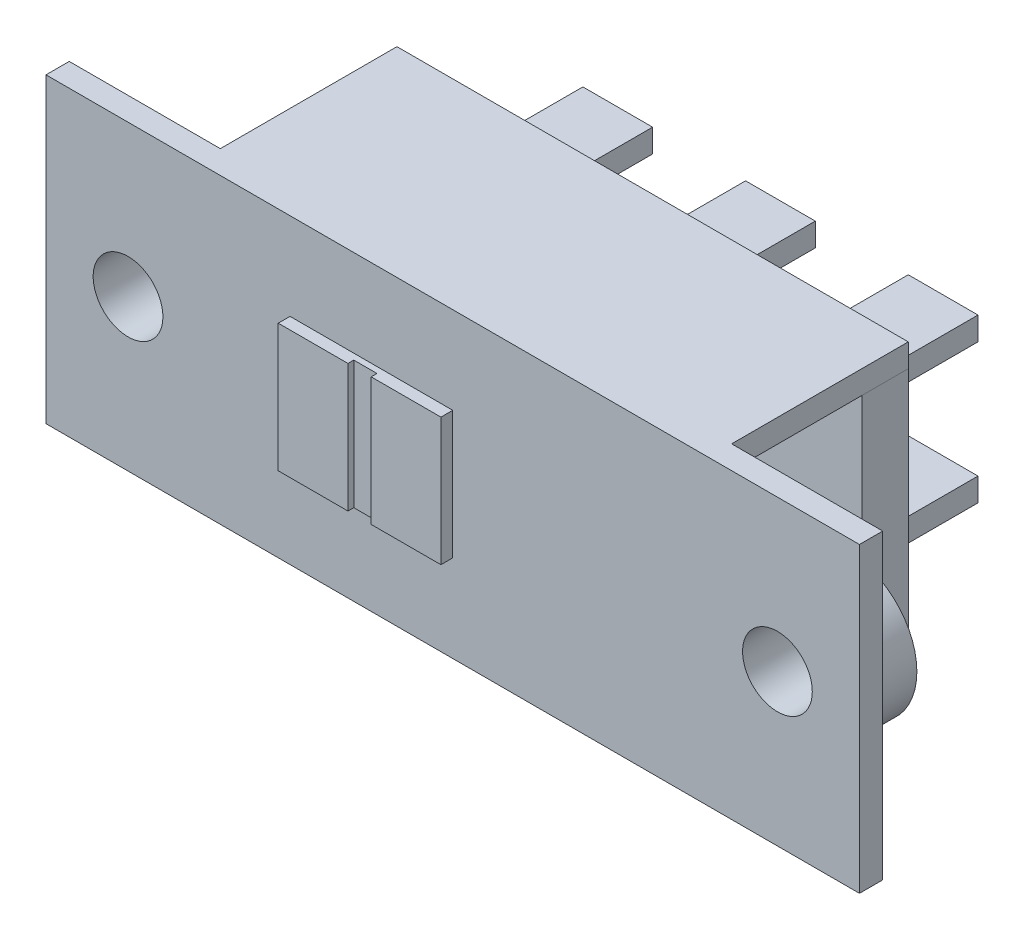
ISO-10303-21;
HEADER;
FILE_DESCRIPTION(('STEP AP214'),'2;1');
FILE_NAME('part.step','',(''),(''),'','','');
FILE_SCHEMA(('AUTOMOTIVE_DESIGN { 1 0 10303 214 1 1 1 1 }'));
ENDSEC;
DATA;
#1=APPLICATION_CONTEXT('core data for automotive mechanical design processes');
#2=APPLICATION_PROTOCOL_DEFINITION('international standard','automotive_design',2000,#1);
#3=PRODUCT_CONTEXT('',#1,'mechanical');
#4=PRODUCT('Part','Part','',(#3));
#5=PRODUCT_RELATED_PRODUCT_CATEGORY('part','',(#4));
#6=PRODUCT_DEFINITION_FORMATION('','',#4);
#7=PRODUCT_DEFINITION_CONTEXT('part definition',#1,'design');
#8=PRODUCT_DEFINITION('design','',#6,#7);
#9=PRODUCT_DEFINITION_SHAPE('','',#8);
#10=(LENGTH_UNIT() NAMED_UNIT(*) SI_UNIT(.MILLI.,.METRE.));
#11=(NAMED_UNIT(*) PLANE_ANGLE_UNIT() SI_UNIT($,.RADIAN.));
#12=(NAMED_UNIT(*) SI_UNIT($,.STERADIAN.) SOLID_ANGLE_UNIT());
#13=UNCERTAINTY_MEASURE_WITH_UNIT(LENGTH_MEASURE(1.E-05),#10,'distance_accuracy_value','');
#14=(GEOMETRIC_REPRESENTATION_CONTEXT(3) GLOBAL_UNCERTAINTY_ASSIGNED_CONTEXT((#13)) GLOBAL_UNIT_ASSIGNED_CONTEXT((#10,
#11,#12)) REPRESENTATION_CONTEXT('',''));
#15=CARTESIAN_POINT('',(0.,0.,0.));
#16=DIRECTION('',(0.,0.,1.));
#17=DIRECTION('',(1.,0.,0.));
#18=AXIS2_PLACEMENT_3D('',#15,#16,#17);
#19=CARTESIAN_POINT('',(-7.,-2.75,1.508));
#20=DIRECTION('',(0.,0.,1.));
#21=DIRECTION('',(1.,0.,0.));
#22=AXIS2_PLACEMENT_3D('',#19,#20,#21);
#23=PLANE('',#22);
#24=DIRECTION('',(0.,1.,0.));
#25=VECTOR('',#24,1.);
#26=CARTESIAN_POINT('',(-3.,-2.75,1.508));
#27=LINE('',#26,#25);
#28=CARTESIAN_POINT('',(-3.,-2.75,1.508));
#29=VERTEX_POINT('',#28);
#30=CARTESIAN_POINT('',(-3.,2.75,1.508));
#31=VERTEX_POINT('',#30);
#32=EDGE_CURVE('E132',#29,#31,#27,.T.);
#33=ORIENTED_EDGE('',*,*,#32,.F.);
#34=DIRECTION('',(1.,0.,0.));
#35=VECTOR('',#34,1.);
#36=CARTESIAN_POINT('',(-7.,-2.75,1.508));
#37=LINE('',#36,#35);
#38=CARTESIAN_POINT('',(0.,-2.75,1.508));
#39=VERTEX_POINT('',#38);
#40=EDGE_CURVE('E143',#29,#39,#37,.T.);
#41=ORIENTED_EDGE('',*,*,#40,.T.);
#42=DIRECTION('',(0.,1.,0.));
#43=VECTOR('',#42,1.);
#44=CARTESIAN_POINT('',(0.,2.75,1.508));
#45=LINE('',#44,#43);
#46=CARTESIAN_POINT('',(0.,2.75,1.508));
#47=VERTEX_POINT('',#46);
#48=EDGE_CURVE('E145',#39,#47,#45,.T.);
#49=ORIENTED_EDGE('',*,*,#48,.T.);
#50=DIRECTION('',(-1.,0.,0.));
#51=VECTOR('',#50,1.);
#52=CARTESIAN_POINT('',(-7.,2.75,1.508));
#53=LINE('',#52,#51);
#54=EDGE_CURVE('E147',#47,#31,#53,.T.);
#55=ORIENTED_EDGE('',*,*,#54,.T.);
#56=EDGE_LOOP('',(#33,#41,#49,#55));
#57=FACE_BOUND('',#56,.T.);
#58=ADVANCED_FACE('F44',(#57),#23,.T.);
#59=CARTESIAN_POINT('',(-7.,2.75,1.508));
#60=DIRECTION('',(1.,0.,0.));
#61=DIRECTION('',(0.,1.,0.));
#62=AXIS2_PLACEMENT_3D('',#59,#60,#61);
#63=PLANE('',#62);
#64=DIRECTION('',(0.,-1.,0.));
#65=VECTOR('',#64,1.);
#66=CARTESIAN_POINT('',(-7.,2.75,1.));
#67=LINE('',#66,#65);
#68=CARTESIAN_POINT('',(-7.,2.75,1.));
#69=VERTEX_POINT('',#68);
#70=CARTESIAN_POINT('',(-7.,-2.75,1.));
#71=VERTEX_POINT('',#70);
#72=EDGE_CURVE('E151',#69,#71,#67,.T.);
#73=ORIENTED_EDGE('',*,*,#72,.T.);
#74=DIRECTION('',(0.,0.,-1.));
#75=VECTOR('',#74,1.);
#76=CARTESIAN_POINT('',(-7.,-2.75,1.508));
#77=LINE('',#76,#75);
#78=CARTESIAN_POINT('',(-7.,-2.75,1.508));
#79=VERTEX_POINT('',#78);
#80=EDGE_CURVE('E12',#79,#71,#77,.T.);
#81=ORIENTED_EDGE('',*,*,#80,.F.);
#82=DIRECTION('',(0.,-1.,0.));
#83=VECTOR('',#82,1.);
#84=CARTESIAN_POINT('',(-7.,2.75,1.508));
#85=LINE('',#84,#83);
#86=CARTESIAN_POINT('',(-7.,2.75,1.508));
#87=VERTEX_POINT('',#86);
#88=EDGE_CURVE('E141',#87,#79,#85,.T.);
#89=ORIENTED_EDGE('',*,*,#88,.F.);
#90=DIRECTION('',(0.,0.,-1.));
#91=VECTOR('',#90,1.);
#92=CARTESIAN_POINT('',(-7.,2.75,1.508));
#93=LINE('',#92,#91);
#94=EDGE_CURVE('E150',#87,#69,#93,.T.);
#95=ORIENTED_EDGE('',*,*,#94,.T.);
#96=EDGE_LOOP('',(#73,#81,#89,#95));
#97=FACE_BOUND('',#96,.T.);
#98=ADVANCED_FACE('F46',(#97),#63,.F.);
#99=CARTESIAN_POINT('',(-7.,-2.75,1.508));
#100=DIRECTION('',(0.,1.,0.));
#101=DIRECTION('',(0.,0.,1.));
#102=AXIS2_PLACEMENT_3D('',#99,#100,#101);
#103=PLANE('',#102);
#104=ORIENTED_EDGE('',*,*,#40,.F.);
#105=DIRECTION('',(0.,0.,1.));
#106=VECTOR('',#105,1.);
#107=CARTESIAN_POINT('',(-3.,-2.75,1.258));
#108=LINE('',#107,#106);
#109=CARTESIAN_POINT('',(-3.,-2.75,1.258));
#110=VERTEX_POINT('',#109);
#111=EDGE_CURVE('E136',#110,#29,#108,.T.);
#112=ORIENTED_EDGE('',*,*,#111,.F.);
#113=DIRECTION('',(1.,0.,0.));
#114=VECTOR('',#113,1.);
#115=CARTESIAN_POINT('',(-4.,-2.75,1.258));
#116=LINE('',#115,#114);
#117=CARTESIAN_POINT('',(-4.,-2.75,1.258));
#118=VERTEX_POINT('',#117);
#119=EDGE_CURVE('E123',#118,#110,#116,.T.);
#120=ORIENTED_EDGE('',*,*,#119,.F.);
#121=DIRECTION('',(0.,0.,1.));
#122=VECTOR('',#121,1.);
#123=CARTESIAN_POINT('',(-4.,-2.75,1.258));
#124=LINE('',#123,#122);
#125=CARTESIAN_POINT('',(-4.,-2.75,1.508));
#126=VERTEX_POINT('',#125);
#127=EDGE_CURVE('E120',#118,#126,#124,.T.);
#128=ORIENTED_EDGE('',*,*,#127,.T.);
#129=EDGE_CURVE('E96',#79,#126,#37,.T.);
#130=ORIENTED_EDGE('',*,*,#129,.F.);
#131=ORIENTED_EDGE('',*,*,#80,.T.);
#132=DIRECTION('',(1.,0.,0.));
#133=VECTOR('',#132,1.);
#134=CARTESIAN_POINT('',(-7.,-2.75,1.));
#135=LINE('',#134,#133);
#136=CARTESIAN_POINT('',(0.,-2.75,1.));
#137=VERTEX_POINT('',#136);
#138=EDGE_CURVE('E154',#71,#137,#135,.T.);
#139=ORIENTED_EDGE('',*,*,#138,.T.);
#140=DIRECTION('',(0.,0.,-1.));
#141=VECTOR('',#140,1.);
#142=CARTESIAN_POINT('',(0.,-2.75,1.508));
#143=LINE('',#142,#141);
#144=EDGE_CURVE('E52',#39,#137,#143,.T.);
#145=ORIENTED_EDGE('',*,*,#144,.F.);
#146=EDGE_LOOP('',(#104,#112,#120,#128,#130,#131,#139,#145));
#147=FACE_BOUND('',#146,.T.);
#148=ADVANCED_FACE('F188',(#147),#103,.F.);
#149=CARTESIAN_POINT('',(0.,2.75,1.508));
#150=DIRECTION('',(-1.,0.,0.));
#151=DIRECTION('',(0.,-1.,0.));
#152=AXIS2_PLACEMENT_3D('',#149,#150,#151);
#153=PLANE('',#152);
#154=DIRECTION('',(0.,1.,0.));
#155=VECTOR('',#154,1.);
#156=CARTESIAN_POINT('',(0.,2.75,1.));
#157=LINE('',#156,#155);
#158=CARTESIAN_POINT('',(0.,2.75,1.));
#159=VERTEX_POINT('',#158);
#160=EDGE_CURVE('E157',#137,#159,#157,.T.);
#161=ORIENTED_EDGE('',*,*,#160,.T.);
#162=DIRECTION('',(0.,0.,-1.));
#163=VECTOR('',#162,1.);
#164=CARTESIAN_POINT('',(0.,2.75,1.508));
#165=LINE('',#164,#163);
#166=EDGE_CURVE('E161',#47,#159,#165,.T.);
#167=ORIENTED_EDGE('',*,*,#166,.F.);
#168=ORIENTED_EDGE('',*,*,#48,.F.);
#169=ORIENTED_EDGE('',*,*,#144,.T.);
#170=EDGE_LOOP('',(#161,#167,#168,#169));
#171=FACE_BOUND('',#170,.T.);
#172=ADVANCED_FACE('F167',(#171),#153,.F.);
#173=CARTESIAN_POINT('',(-7.,2.75,1.508));
#174=DIRECTION('',(0.,-1.,0.));
#175=DIRECTION('',(0.,0.,-1.));
#176=AXIS2_PLACEMENT_3D('',#173,#174,#175);
#177=PLANE('',#176);
#178=DIRECTION('',(-1.,0.,0.));
#179=VECTOR('',#178,1.);
#180=CARTESIAN_POINT('',(-3.,2.75,1.258));
#181=LINE('',#180,#179);
#182=CARTESIAN_POINT('',(-3.,2.75,1.258));
#183=VERTEX_POINT('',#182);
#184=CARTESIAN_POINT('',(-4.,2.75,1.258));
#185=VERTEX_POINT('',#184);
#186=EDGE_CURVE('E124',#183,#185,#181,.T.);
#187=ORIENTED_EDGE('',*,*,#186,.F.);
#188=DIRECTION('',(0.,0.,1.));
#189=VECTOR('',#188,1.);
#190=CARTESIAN_POINT('',(-3.,2.75,1.258));
#191=LINE('',#190,#189);
#192=EDGE_CURVE('E155',#183,#31,#191,.T.);
#193=ORIENTED_EDGE('',*,*,#192,.T.);
#194=ORIENTED_EDGE('',*,*,#54,.F.);
#195=ORIENTED_EDGE('',*,*,#166,.T.);
#196=DIRECTION('',(-1.,0.,0.));
#197=VECTOR('',#196,1.);
#198=CARTESIAN_POINT('',(-7.,2.75,1.));
#199=LINE('',#198,#197);
#200=EDGE_CURVE('E89',#159,#69,#199,.T.);
#201=ORIENTED_EDGE('',*,*,#200,.T.);
#202=ORIENTED_EDGE('',*,*,#94,.F.);
#203=CARTESIAN_POINT('',(-4.,2.75,1.508));
#204=VERTEX_POINT('',#203);
#205=EDGE_CURVE('E67',#204,#87,#53,.T.);
#206=ORIENTED_EDGE('',*,*,#205,.F.);
#207=DIRECTION('',(0.,0.,1.));
#208=VECTOR('',#207,1.);
#209=CARTESIAN_POINT('',(-4.,2.75,1.258));
#210=LINE('',#209,#208);
#211=EDGE_CURVE('E59',#185,#204,#210,.T.);
#212=ORIENTED_EDGE('',*,*,#211,.F.);
#213=EDGE_LOOP('',(#187,#193,#194,#195,#201,#202,#206,#212));
#214=FACE_BOUND('',#213,.T.);
#215=ADVANCED_FACE('F134',(#214),#177,.F.);
#216=DIRECTION('',(0.,-1.,0.));
#217=VECTOR('',#216,1.);
#218=CARTESIAN_POINT('',(-4.,2.75,1.508));
#219=LINE('',#218,#217);
#220=EDGE_CURVE('E177',#204,#126,#219,.T.);
#221=ORIENTED_EDGE('',*,*,#220,.F.);
#222=ORIENTED_EDGE('',*,*,#205,.T.);
#223=ORIENTED_EDGE('',*,*,#88,.T.);
#224=ORIENTED_EDGE('',*,*,#129,.T.);
#225=EDGE_LOOP('',(#221,#222,#223,#224));
#226=FACE_BOUND('',#225,.T.);
#227=ADVANCED_FACE('F176',(#226),#23,.T.);
#228=CARTESIAN_POINT('',(-7.,-2.75,1.));
#229=DIRECTION('',(0.,0.,1.));
#230=DIRECTION('',(1.,0.,0.));
#231=AXIS2_PLACEMENT_3D('',#228,#229,#230);
#232=PLANE('',#231);
#233=ORIENTED_EDGE('',*,*,#72,.F.);
#234=ORIENTED_EDGE('',*,*,#200,.F.);
#235=ORIENTED_EDGE('',*,*,#160,.F.);
#236=ORIENTED_EDGE('',*,*,#138,.F.);
#237=EDGE_LOOP('',(#233,#234,#235,#236));
#238=FACE_BOUND('',#237,.T.);
#239=ADVANCED_FACE('F172',(#238),#232,.F.);
#240=CARTESIAN_POINT('',(-3.,-2.75,1.258));
#241=DIRECTION('',(1.,0.,0.));
#242=DIRECTION('',(0.,0.,-1.));
#243=AXIS2_PLACEMENT_3D('',#240,#241,#242);
#244=PLANE('',#243);
#245=ORIENTED_EDGE('',*,*,#32,.T.);
#246=ORIENTED_EDGE('',*,*,#192,.F.);
#247=DIRECTION('',(0.,1.,0.));
#248=VECTOR('',#247,1.);
#249=CARTESIAN_POINT('',(-3.,-2.75,1.258));
#250=LINE('',#249,#248);
#251=EDGE_CURVE('E130',#110,#183,#250,.T.);
#252=ORIENTED_EDGE('',*,*,#251,.F.);
#253=ORIENTED_EDGE('',*,*,#111,.T.);
#254=EDGE_LOOP('',(#245,#246,#252,#253));
#255=FACE_BOUND('',#254,.T.);
#256=ADVANCED_FACE('F185',(#255),#244,.F.);
#257=CARTESIAN_POINT('',(-4.,2.75,1.258));
#258=DIRECTION('',(-1.,0.,0.));
#259=DIRECTION('',(0.,-1.,0.));
#260=AXIS2_PLACEMENT_3D('',#257,#258,#259);
#261=PLANE('',#260);
#262=ORIENTED_EDGE('',*,*,#220,.T.);
#263=ORIENTED_EDGE('',*,*,#127,.F.);
#264=DIRECTION('',(0.,-1.,0.));
#265=VECTOR('',#264,1.);
#266=CARTESIAN_POINT('',(-4.,2.75,1.258));
#267=LINE('',#266,#265);
#268=EDGE_CURVE('E117',#185,#118,#267,.T.);
#269=ORIENTED_EDGE('',*,*,#268,.F.);
#270=ORIENTED_EDGE('',*,*,#211,.T.);
#271=EDGE_LOOP('',(#262,#263,#269,#270));
#272=FACE_BOUND('',#271,.T.);
#273=ADVANCED_FACE('F119',(#272),#261,.F.);
#274=CARTESIAN_POINT('',(-4.,2.75,1.258));
#275=DIRECTION('',(0.,0.,1.));
#276=DIRECTION('',(1.,0.,0.));
#277=AXIS2_PLACEMENT_3D('',#274,#275,#276);
#278=PLANE('',#277);
#279=ORIENTED_EDGE('',*,*,#186,.T.);
#280=ORIENTED_EDGE('',*,*,#268,.T.);
#281=ORIENTED_EDGE('',*,*,#119,.T.);
#282=ORIENTED_EDGE('',*,*,#251,.T.);
#283=EDGE_LOOP('',(#279,#280,#281,#282));
#284=FACE_BOUND('',#283,.T.);
#285=ADVANCED_FACE('F128',(#284),#278,.T.);
#286=CLOSED_SHELL('',(#58,#98,#148,#172,#215,#227,#239,#256,#273,#285));
#287=MANIFOLD_SOLID_BREP('B2',#286);
#288=CARTESIAN_POINT('',(5.5,2.5,-13.1));
#289=DIRECTION('',(1.,0.,0.));
#290=DIRECTION('',(0.,0.,-1.));
#291=AXIS2_PLACEMENT_3D('',#288,#289,#290);
#292=PLANE('',#291);
#293=DIRECTION('',(0.,1.,0.));
#294=VECTOR('',#293,1.);
#295=CARTESIAN_POINT('',(5.5,2.5,-7.6));
#296=LINE('',#295,#294);
#297=CARTESIAN_POINT('',(5.5,2.5,-7.6));
#298=VERTEX_POINT('',#297);
#299=CARTESIAN_POINT('',(5.5,3.5,-7.6));
#300=VERTEX_POINT('',#299);
#301=EDGE_CURVE('E342',#298,#300,#296,.T.);
#302=ORIENTED_EDGE('',*,*,#301,.T.);
#303=DIRECTION('',(0.,0.,1.));
#304=VECTOR('',#303,1.);
#305=CARTESIAN_POINT('',(5.5,3.5,-13.1));
#306=LINE('',#305,#304);
#307=CARTESIAN_POINT('',(5.5,3.5,-13.1));
#308=VERTEX_POINT('',#307);
#309=EDGE_CURVE('E42',#308,#300,#306,.T.);
#310=ORIENTED_EDGE('',*,*,#309,.F.);
#311=DIRECTION('',(0.,1.,0.));
#312=VECTOR('',#311,1.);
#313=CARTESIAN_POINT('',(5.5,2.5,-13.1));
#314=LINE('',#313,#312);
#315=CARTESIAN_POINT('',(5.5,2.5,-13.1));
#316=VERTEX_POINT('',#315);
#317=EDGE_CURVE('E330',#316,#308,#314,.T.);
#318=ORIENTED_EDGE('',*,*,#317,.F.);
#319=DIRECTION('',(0.,0.,1.));
#320=VECTOR('',#319,1.);
#321=CARTESIAN_POINT('',(5.5,2.5,-13.1));
#322=LINE('',#321,#320);
#323=EDGE_CURVE('E338',#316,#298,#322,.T.);
#324=ORIENTED_EDGE('',*,*,#323,.T.);
#325=EDGE_LOOP('',(#302,#310,#318,#324));
#326=FACE_BOUND('',#325,.T.);
#327=ADVANCED_FACE('F279',(#326),#292,.F.);
#328=CARTESIAN_POINT('',(5.5,3.5,-13.1));
#329=DIRECTION('',(0.,-1.,0.));
#330=DIRECTION('',(0.,0.,-1.));
#331=AXIS2_PLACEMENT_3D('',#328,#329,#330);
#332=PLANE('',#331);
#333=DIRECTION('',(1.,0.,0.));
#334=VECTOR('',#333,1.);
#335=CARTESIAN_POINT('',(5.5,3.5,-7.6));
#336=LINE('',#335,#334);
#337=CARTESIAN_POINT('',(8.5,3.5,-7.6));
#338=VERTEX_POINT('',#337);
#339=EDGE_CURVE('E334',#300,#338,#336,.T.);
#340=ORIENTED_EDGE('',*,*,#339,.T.);
#341=DIRECTION('',(0.,0.,1.));
#342=VECTOR('',#341,1.);
#343=CARTESIAN_POINT('',(8.5,3.5,-13.1));
#344=LINE('',#343,#342);
#345=CARTESIAN_POINT('',(8.5,3.5,-13.1));
#346=VERTEX_POINT('',#345);
#347=EDGE_CURVE('E287',#346,#338,#344,.T.);
#348=ORIENTED_EDGE('',*,*,#347,.F.);
#349=DIRECTION('',(1.,0.,0.));
#350=VECTOR('',#349,1.);
#351=CARTESIAN_POINT('',(5.5,3.5,-13.1));
#352=LINE('',#351,#350);
#353=EDGE_CURVE('E325',#308,#346,#352,.T.);
#354=ORIENTED_EDGE('',*,*,#353,.F.);
#355=ORIENTED_EDGE('',*,*,#309,.T.);
#356=EDGE_LOOP('',(#340,#348,#354,#355));
#357=FACE_BOUND('',#356,.T.);
#358=ADVANCED_FACE('F333',(#357),#332,.F.);
#359=CARTESIAN_POINT('',(8.5,2.5,-13.1));
#360=DIRECTION('',(-1.,0.,0.));
#361=DIRECTION('',(0.,0.,1.));
#362=AXIS2_PLACEMENT_3D('',#359,#360,#361);
#363=PLANE('',#362);
#364=DIRECTION('',(0.,-1.,0.));
#365=VECTOR('',#364,1.);
#366=CARTESIAN_POINT('',(8.5,2.5,-7.6));
#367=LINE('',#366,#365);
#368=CARTESIAN_POINT('',(8.5,2.5,-7.6));
#369=VERTEX_POINT('',#368);
#370=EDGE_CURVE('E312',#338,#369,#367,.T.);
#371=ORIENTED_EDGE('',*,*,#370,.T.);
#372=DIRECTION('',(0.,0.,1.));
#373=VECTOR('',#372,1.);
#374=CARTESIAN_POINT('',(8.5,2.5,-13.1));
#375=LINE('',#374,#373);
#376=CARTESIAN_POINT('',(8.5,2.5,-13.1));
#377=VERTEX_POINT('',#376);
#378=EDGE_CURVE('E335',#377,#369,#375,.T.);
#379=ORIENTED_EDGE('',*,*,#378,.F.);
#380=DIRECTION('',(0.,-1.,0.));
#381=VECTOR('',#380,1.);
#382=CARTESIAN_POINT('',(8.5,2.5,-13.1));
#383=LINE('',#382,#381);
#384=EDGE_CURVE('E328',#346,#377,#383,.T.);
#385=ORIENTED_EDGE('',*,*,#384,.F.);
#386=ORIENTED_EDGE('',*,*,#347,.T.);
#387=EDGE_LOOP('',(#371,#379,#385,#386));
#388=FACE_BOUND('',#387,.T.);
#389=ADVANCED_FACE('F336',(#388),#363,.F.);
#390=CARTESIAN_POINT('',(5.5,2.5,-13.1));
#391=DIRECTION('',(0.,1.,0.));
#392=DIRECTION('',(0.,0.,1.));
#393=AXIS2_PLACEMENT_3D('',#390,#391,#392);
#394=PLANE('',#393);
#395=DIRECTION('',(-1.,0.,0.));
#396=VECTOR('',#395,1.);
#397=CARTESIAN_POINT('',(5.5,2.5,-7.6));
#398=LINE('',#397,#396);
#399=EDGE_CURVE('E318',#369,#298,#398,.T.);
#400=ORIENTED_EDGE('',*,*,#399,.T.);
#401=ORIENTED_EDGE('',*,*,#323,.F.);
#402=DIRECTION('',(-1.,0.,0.));
#403=VECTOR('',#402,1.);
#404=CARTESIAN_POINT('',(5.5,2.5,-13.1));
#405=LINE('',#404,#403);
#406=EDGE_CURVE('E295',#377,#316,#405,.T.);
#407=ORIENTED_EDGE('',*,*,#406,.F.);
#408=ORIENTED_EDGE('',*,*,#378,.T.);
#409=EDGE_LOOP('',(#400,#401,#407,#408));
#410=FACE_BOUND('',#409,.T.);
#411=ADVANCED_FACE('F349',(#410),#394,.F.);
#412=CARTESIAN_POINT('',(5.5,3.5,-13.1));
#413=DIRECTION('',(0.,0.,-1.));
#414=DIRECTION('',(-1.,0.,0.));
#415=AXIS2_PLACEMENT_3D('',#412,#413,#414);
#416=PLANE('',#415);
#417=ORIENTED_EDGE('',*,*,#317,.T.);
#418=ORIENTED_EDGE('',*,*,#353,.T.);
#419=ORIENTED_EDGE('',*,*,#384,.T.);
#420=ORIENTED_EDGE('',*,*,#406,.T.);
#421=EDGE_LOOP('',(#417,#418,#419,#420));
#422=FACE_BOUND('',#421,.T.);
#423=ADVANCED_FACE('F326',(#422),#416,.T.);
#424=CARTESIAN_POINT('',(5.5,3.5,-7.6));
#425=DIRECTION('',(0.,0.,-1.));
#426=DIRECTION('',(-1.,0.,0.));
#427=AXIS2_PLACEMENT_3D('',#424,#425,#426);
#428=PLANE('',#427);
#429=ORIENTED_EDGE('',*,*,#301,.F.);
#430=ORIENTED_EDGE('',*,*,#399,.F.);
#431=ORIENTED_EDGE('',*,*,#370,.F.);
#432=ORIENTED_EDGE('',*,*,#339,.F.);
#433=EDGE_LOOP('',(#429,#430,#431,#432));
#434=FACE_BOUND('',#433,.T.);
#435=ADVANCED_FACE('F352',(#434),#428,.F.);
#436=CLOSED_SHELL('',(#327,#358,#389,#411,#423,#435));
#437=MANIFOLD_SOLID_BREP('B6',#436);
#438=CARTESIAN_POINT('',(-1.5,2.5,-13.1));
#439=DIRECTION('',(1.,0.,0.));
#440=DIRECTION('',(0.,0.,-1.));
#441=AXIS2_PLACEMENT_3D('',#438,#439,#440);
#442=PLANE('',#441);
#443=DIRECTION('',(0.,1.,0.));
#444=VECTOR('',#443,1.);
#445=CARTESIAN_POINT('',(-1.5,2.5,-7.6));
#446=LINE('',#445,#444);
#447=CARTESIAN_POINT('',(-1.5,2.5,-7.6));
#448=VERTEX_POINT('',#447);
#449=CARTESIAN_POINT('',(-1.5,3.5,-7.6));
#450=VERTEX_POINT('',#449);
#451=EDGE_CURVE('E476',#448,#450,#446,.T.);
#452=ORIENTED_EDGE('',*,*,#451,.T.);
#453=DIRECTION('',(0.,0.,1.));
#454=VECTOR('',#453,1.);
#455=CARTESIAN_POINT('',(-1.5,3.5,-13.1));
#456=LINE('',#455,#454);
#457=CARTESIAN_POINT('',(-1.5,3.5,-13.1));
#458=VERTEX_POINT('',#457);
#459=EDGE_CURVE('E277',#458,#450,#456,.T.);
#460=ORIENTED_EDGE('',*,*,#459,.F.);
#461=DIRECTION('',(0.,1.,0.));
#462=VECTOR('',#461,1.);
#463=CARTESIAN_POINT('',(-1.5,2.5,-13.1));
#464=LINE('',#463,#462);
#465=CARTESIAN_POINT('',(-1.5,2.5,-13.1));
#466=VERTEX_POINT('',#465);
#467=EDGE_CURVE('E464',#466,#458,#464,.T.);
#468=ORIENTED_EDGE('',*,*,#467,.F.);
#469=DIRECTION('',(0.,0.,1.));
#470=VECTOR('',#469,1.);
#471=CARTESIAN_POINT('',(-1.5,2.5,-13.1));
#472=LINE('',#471,#470);
#473=EDGE_CURVE('E472',#466,#448,#472,.T.);
#474=ORIENTED_EDGE('',*,*,#473,.T.);
#475=EDGE_LOOP('',(#452,#460,#468,#474));
#476=FACE_BOUND('',#475,.T.);
#477=ADVANCED_FACE('F413',(#476),#442,.F.);
#478=CARTESIAN_POINT('',(-1.5,3.5,-13.1));
#479=DIRECTION('',(0.,-1.,0.));
#480=DIRECTION('',(0.,0.,-1.));
#481=AXIS2_PLACEMENT_3D('',#478,#479,#480);
#482=PLANE('',#481);
#483=DIRECTION('',(1.,0.,0.));
#484=VECTOR('',#483,1.);
#485=CARTESIAN_POINT('',(-1.5,3.5,-7.6));
#486=LINE('',#485,#484);
#487=CARTESIAN_POINT('',(1.5,3.5,-7.6));
#488=VERTEX_POINT('',#487);
#489=EDGE_CURVE('E468',#450,#488,#486,.T.);
#490=ORIENTED_EDGE('',*,*,#489,.T.);
#491=DIRECTION('',(0.,0.,1.));
#492=VECTOR('',#491,1.);
#493=CARTESIAN_POINT('',(1.5,3.5,-13.1));
#494=LINE('',#493,#492);
#495=CARTESIAN_POINT('',(1.5,3.5,-13.1));
#496=VERTEX_POINT('',#495);
#497=EDGE_CURVE('E421',#496,#488,#494,.T.);
#498=ORIENTED_EDGE('',*,*,#497,.F.);
#499=DIRECTION('',(1.,0.,0.));
#500=VECTOR('',#499,1.);
#501=CARTESIAN_POINT('',(-1.5,3.5,-13.1));
#502=LINE('',#501,#500);
#503=EDGE_CURVE('E459',#458,#496,#502,.T.);
#504=ORIENTED_EDGE('',*,*,#503,.F.);
#505=ORIENTED_EDGE('',*,*,#459,.T.);
#506=EDGE_LOOP('',(#490,#498,#504,#505));
#507=FACE_BOUND('',#506,.T.);
#508=ADVANCED_FACE('F467',(#507),#482,.F.);
#509=CARTESIAN_POINT('',(1.5,2.5,-13.1));
#510=DIRECTION('',(-1.,0.,0.));
#511=DIRECTION('',(0.,0.,1.));
#512=AXIS2_PLACEMENT_3D('',#509,#510,#511);
#513=PLANE('',#512);
#514=DIRECTION('',(0.,-1.,0.));
#515=VECTOR('',#514,1.);
#516=CARTESIAN_POINT('',(1.5,2.5,-7.6));
#517=LINE('',#516,#515);
#518=CARTESIAN_POINT('',(1.5,2.5,-7.6));
#519=VERTEX_POINT('',#518);
#520=EDGE_CURVE('E446',#488,#519,#517,.T.);
#521=ORIENTED_EDGE('',*,*,#520,.T.);
#522=DIRECTION('',(0.,0.,1.));
#523=VECTOR('',#522,1.);
#524=CARTESIAN_POINT('',(1.5,2.5,-13.1));
#525=LINE('',#524,#523);
#526=CARTESIAN_POINT('',(1.5,2.5,-13.1));
#527=VERTEX_POINT('',#526);
#528=EDGE_CURVE('E469',#527,#519,#525,.T.);
#529=ORIENTED_EDGE('',*,*,#528,.F.);
#530=DIRECTION('',(0.,-1.,0.));
#531=VECTOR('',#530,1.);
#532=CARTESIAN_POINT('',(1.5,2.5,-13.1));
#533=LINE('',#532,#531);
#534=EDGE_CURVE('E462',#496,#527,#533,.T.);
#535=ORIENTED_EDGE('',*,*,#534,.F.);
#536=ORIENTED_EDGE('',*,*,#497,.T.);
#537=EDGE_LOOP('',(#521,#529,#535,#536));
#538=FACE_BOUND('',#537,.T.);
#539=ADVANCED_FACE('F470',(#538),#513,.F.);
#540=CARTESIAN_POINT('',(-1.5,2.5,-13.1));
#541=DIRECTION('',(0.,1.,0.));
#542=DIRECTION('',(0.,0.,1.));
#543=AXIS2_PLACEMENT_3D('',#540,#541,#542);
#544=PLANE('',#543);
#545=DIRECTION('',(-1.,0.,0.));
#546=VECTOR('',#545,1.);
#547=CARTESIAN_POINT('',(-1.5,2.5,-7.6));
#548=LINE('',#547,#546);
#549=EDGE_CURVE('E452',#519,#448,#548,.T.);
#550=ORIENTED_EDGE('',*,*,#549,.T.);
#551=ORIENTED_EDGE('',*,*,#473,.F.);
#552=DIRECTION('',(-1.,0.,0.));
#553=VECTOR('',#552,1.);
#554=CARTESIAN_POINT('',(-1.5,2.5,-13.1));
#555=LINE('',#554,#553);
#556=EDGE_CURVE('E429',#527,#466,#555,.T.);
#557=ORIENTED_EDGE('',*,*,#556,.F.);
#558=ORIENTED_EDGE('',*,*,#528,.T.);
#559=EDGE_LOOP('',(#550,#551,#557,#558));
#560=FACE_BOUND('',#559,.T.);
#561=ADVANCED_FACE('F483',(#560),#544,.F.);
#562=CARTESIAN_POINT('',(-1.5,3.5,-13.1));
#563=DIRECTION('',(0.,0.,-1.));
#564=DIRECTION('',(-1.,0.,0.));
#565=AXIS2_PLACEMENT_3D('',#562,#563,#564);
#566=PLANE('',#565);
#567=ORIENTED_EDGE('',*,*,#467,.T.);
#568=ORIENTED_EDGE('',*,*,#503,.T.);
#569=ORIENTED_EDGE('',*,*,#534,.T.);
#570=ORIENTED_EDGE('',*,*,#556,.T.);
#571=EDGE_LOOP('',(#567,#568,#569,#570));
#572=FACE_BOUND('',#571,.T.);
#573=ADVANCED_FACE('F460',(#572),#566,.T.);
#574=CARTESIAN_POINT('',(-1.5,3.5,-7.6));
#575=DIRECTION('',(0.,0.,-1.));
#576=DIRECTION('',(-1.,0.,0.));
#577=AXIS2_PLACEMENT_3D('',#574,#575,#576);
#578=PLANE('',#577);
#579=ORIENTED_EDGE('',*,*,#451,.F.);
#580=ORIENTED_EDGE('',*,*,#549,.F.);
#581=ORIENTED_EDGE('',*,*,#520,.F.);
#582=ORIENTED_EDGE('',*,*,#489,.F.);
#583=EDGE_LOOP('',(#579,#580,#581,#582));
#584=FACE_BOUND('',#583,.T.);
#585=ADVANCED_FACE('F486',(#584),#578,.F.);
#586=CLOSED_SHELL('',(#477,#508,#539,#561,#573,#585));
#587=MANIFOLD_SOLID_BREP('B36',#586);
#588=CARTESIAN_POINT('',(-8.5,2.5,-13.1));
#589=DIRECTION('',(1.,0.,0.));
#590=DIRECTION('',(0.,0.,-1.));
#591=AXIS2_PLACEMENT_3D('',#588,#589,#590);
#592=PLANE('',#591);
#593=DIRECTION('',(0.,1.,0.));
#594=VECTOR('',#593,1.);
#595=CARTESIAN_POINT('',(-8.5,2.5,-7.6));
#596=LINE('',#595,#594);
#597=CARTESIAN_POINT('',(-8.5,2.5,-7.6));
#598=VERTEX_POINT('',#597);
#599=CARTESIAN_POINT('',(-8.5,3.5,-7.6));
#600=VERTEX_POINT('',#599);
#601=EDGE_CURVE('E610',#598,#600,#596,.T.);
#602=ORIENTED_EDGE('',*,*,#601,.T.);
#603=DIRECTION('',(0.,0.,1.));
#604=VECTOR('',#603,1.);
#605=CARTESIAN_POINT('',(-8.5,3.5,-13.1));
#606=LINE('',#605,#604);
#607=CARTESIAN_POINT('',(-8.5,3.5,-13.1));
#608=VERTEX_POINT('',#607);
#609=EDGE_CURVE('E411',#608,#600,#606,.T.);
#610=ORIENTED_EDGE('',*,*,#609,.F.);
#611=DIRECTION('',(0.,1.,0.));
#612=VECTOR('',#611,1.);
#613=CARTESIAN_POINT('',(-8.5,2.5,-13.1));
#614=LINE('',#613,#612);
#615=CARTESIAN_POINT('',(-8.5,2.5,-13.1));
#616=VERTEX_POINT('',#615);
#617=EDGE_CURVE('E598',#616,#608,#614,.T.);
#618=ORIENTED_EDGE('',*,*,#617,.F.);
#619=DIRECTION('',(0.,0.,1.));
#620=VECTOR('',#619,1.);
#621=CARTESIAN_POINT('',(-8.5,2.5,-13.1));
#622=LINE('',#621,#620);
#623=EDGE_CURVE('E606',#616,#598,#622,.T.);
#624=ORIENTED_EDGE('',*,*,#623,.T.);
#625=EDGE_LOOP('',(#602,#610,#618,#624));
#626=FACE_BOUND('',#625,.T.);
#627=ADVANCED_FACE('F547',(#626),#592,.F.);
#628=CARTESIAN_POINT('',(-8.5,3.5,-13.1));
#629=DIRECTION('',(0.,-1.,0.));
#630=DIRECTION('',(0.,0.,-1.));
#631=AXIS2_PLACEMENT_3D('',#628,#629,#630);
#632=PLANE('',#631);
#633=DIRECTION('',(1.,0.,0.));
#634=VECTOR('',#633,1.);
#635=CARTESIAN_POINT('',(-8.5,3.5,-7.6));
#636=LINE('',#635,#634);
#637=CARTESIAN_POINT('',(-5.5,3.5,-7.6));
#638=VERTEX_POINT('',#637);
#639=EDGE_CURVE('E602',#600,#638,#636,.T.);
#640=ORIENTED_EDGE('',*,*,#639,.T.);
#641=DIRECTION('',(0.,0.,1.));
#642=VECTOR('',#641,1.);
#643=CARTESIAN_POINT('',(-5.5,3.5,-13.1));
#644=LINE('',#643,#642);
#645=CARTESIAN_POINT('',(-5.5,3.5,-13.1));
#646=VERTEX_POINT('',#645);
#647=EDGE_CURVE('E555',#646,#638,#644,.T.);
#648=ORIENTED_EDGE('',*,*,#647,.F.);
#649=DIRECTION('',(1.,0.,0.));
#650=VECTOR('',#649,1.);
#651=CARTESIAN_POINT('',(-8.5,3.5,-13.1));
#652=LINE('',#651,#650);
#653=EDGE_CURVE('E593',#608,#646,#652,.T.);
#654=ORIENTED_EDGE('',*,*,#653,.F.);
#655=ORIENTED_EDGE('',*,*,#609,.T.);
#656=EDGE_LOOP('',(#640,#648,#654,#655));
#657=FACE_BOUND('',#656,.T.);
#658=ADVANCED_FACE('F601',(#657),#632,.F.);
#659=CARTESIAN_POINT('',(-5.5,2.5,-13.1));
#660=DIRECTION('',(-1.,0.,0.));
#661=DIRECTION('',(0.,0.,1.));
#662=AXIS2_PLACEMENT_3D('',#659,#660,#661);
#663=PLANE('',#662);
#664=DIRECTION('',(0.,-1.,0.));
#665=VECTOR('',#664,1.);
#666=CARTESIAN_POINT('',(-5.5,2.5,-7.6));
#667=LINE('',#666,#665);
#668=CARTESIAN_POINT('',(-5.5,2.5,-7.6));
#669=VERTEX_POINT('',#668);
#670=EDGE_CURVE('E580',#638,#669,#667,.T.);
#671=ORIENTED_EDGE('',*,*,#670,.T.);
#672=DIRECTION('',(0.,0.,1.));
#673=VECTOR('',#672,1.);
#674=CARTESIAN_POINT('',(-5.5,2.5,-13.1));
#675=LINE('',#674,#673);
#676=CARTESIAN_POINT('',(-5.5,2.5,-13.1));
#677=VERTEX_POINT('',#676);
#678=EDGE_CURVE('E603',#677,#669,#675,.T.);
#679=ORIENTED_EDGE('',*,*,#678,.F.);
#680=DIRECTION('',(0.,-1.,0.));
#681=VECTOR('',#680,1.);
#682=CARTESIAN_POINT('',(-5.5,2.5,-13.1));
#683=LINE('',#682,#681);
#684=EDGE_CURVE('E596',#646,#677,#683,.T.);
#685=ORIENTED_EDGE('',*,*,#684,.F.);
#686=ORIENTED_EDGE('',*,*,#647,.T.);
#687=EDGE_LOOP('',(#671,#679,#685,#686));
#688=FACE_BOUND('',#687,.T.);
#689=ADVANCED_FACE('F604',(#688),#663,.F.);
#690=CARTESIAN_POINT('',(-8.5,2.5,-13.1));
#691=DIRECTION('',(0.,1.,0.));
#692=DIRECTION('',(0.,0.,1.));
#693=AXIS2_PLACEMENT_3D('',#690,#691,#692);
#694=PLANE('',#693);
#695=DIRECTION('',(-1.,0.,0.));
#696=VECTOR('',#695,1.);
#697=CARTESIAN_POINT('',(-8.5,2.5,-7.6));
#698=LINE('',#697,#696);
#699=EDGE_CURVE('E586',#669,#598,#698,.T.);
#700=ORIENTED_EDGE('',*,*,#699,.T.);
#701=ORIENTED_EDGE('',*,*,#623,.F.);
#702=DIRECTION('',(-1.,0.,0.));
#703=VECTOR('',#702,1.);
#704=CARTESIAN_POINT('',(-8.5,2.5,-13.1));
#705=LINE('',#704,#703);
#706=EDGE_CURVE('E563',#677,#616,#705,.T.);
#707=ORIENTED_EDGE('',*,*,#706,.F.);
#708=ORIENTED_EDGE('',*,*,#678,.T.);
#709=EDGE_LOOP('',(#700,#701,#707,#708));
#710=FACE_BOUND('',#709,.T.);
#711=ADVANCED_FACE('F617',(#710),#694,.F.);
#712=CARTESIAN_POINT('',(-8.5,3.5,-13.1));
#713=DIRECTION('',(0.,0.,-1.));
#714=DIRECTION('',(-1.,0.,0.));
#715=AXIS2_PLACEMENT_3D('',#712,#713,#714);
#716=PLANE('',#715);
#717=ORIENTED_EDGE('',*,*,#617,.T.);
#718=ORIENTED_EDGE('',*,*,#653,.T.);
#719=ORIENTED_EDGE('',*,*,#684,.T.);
#720=ORIENTED_EDGE('',*,*,#706,.T.);
#721=EDGE_LOOP('',(#717,#718,#719,#720));
#722=FACE_BOUND('',#721,.T.);
#723=ADVANCED_FACE('F594',(#722),#716,.T.);
#724=CARTESIAN_POINT('',(-8.5,3.5,-7.6));
#725=DIRECTION('',(0.,0.,-1.));
#726=DIRECTION('',(-1.,0.,0.));
#727=AXIS2_PLACEMENT_3D('',#724,#725,#726);
#728=PLANE('',#727);
#729=ORIENTED_EDGE('',*,*,#601,.F.);
#730=ORIENTED_EDGE('',*,*,#699,.F.);
#731=ORIENTED_EDGE('',*,*,#670,.F.);
#732=ORIENTED_EDGE('',*,*,#639,.F.);
#733=EDGE_LOOP('',(#729,#730,#731,#732));
#734=FACE_BOUND('',#733,.T.);
#735=ADVANCED_FACE('F620',(#734),#728,.F.);
#736=CLOSED_SHELL('',(#627,#658,#689,#711,#723,#735));
#737=MANIFOLD_SOLID_BREP('B271',#736);
#738=CARTESIAN_POINT('',(5.5,-3.5,-13.1));
#739=DIRECTION('',(1.,0.,0.));
#740=DIRECTION('',(0.,0.,-1.));
#741=AXIS2_PLACEMENT_3D('',#738,#739,#740);
#742=PLANE('',#741);
#743=DIRECTION('',(0.,1.,0.));
#744=VECTOR('',#743,1.);
#745=CARTESIAN_POINT('',(5.5,-3.5,-7.6));
#746=LINE('',#745,#744);
#747=CARTESIAN_POINT('',(5.5,-3.5,-7.6));
#748=VERTEX_POINT('',#747);
#749=CARTESIAN_POINT('',(5.5,-2.5,-7.6));
#750=VERTEX_POINT('',#749);
#751=EDGE_CURVE('E744',#748,#750,#746,.T.);
#752=ORIENTED_EDGE('',*,*,#751,.T.);
#753=DIRECTION('',(0.,0.,1.));
#754=VECTOR('',#753,1.);
#755=CARTESIAN_POINT('',(5.5,-2.5,-13.1));
#756=LINE('',#755,#754);
#757=CARTESIAN_POINT('',(5.5,-2.5,-13.1));
#758=VERTEX_POINT('',#757);
#759=EDGE_CURVE('E545',#758,#750,#756,.T.);
#760=ORIENTED_EDGE('',*,*,#759,.F.);
#761=DIRECTION('',(0.,1.,0.));
#762=VECTOR('',#761,1.);
#763=CARTESIAN_POINT('',(5.5,-3.5,-13.1));
#764=LINE('',#763,#762);
#765=CARTESIAN_POINT('',(5.5,-3.5,-13.1));
#766=VERTEX_POINT('',#765);
#767=EDGE_CURVE('E732',#766,#758,#764,.T.);
#768=ORIENTED_EDGE('',*,*,#767,.F.);
#769=DIRECTION('',(0.,0.,1.));
#770=VECTOR('',#769,1.);
#771=CARTESIAN_POINT('',(5.5,-3.5,-13.1));
#772=LINE('',#771,#770);
#773=EDGE_CURVE('E740',#766,#748,#772,.T.);
#774=ORIENTED_EDGE('',*,*,#773,.T.);
#775=EDGE_LOOP('',(#752,#760,#768,#774));
#776=FACE_BOUND('',#775,.T.);
#777=ADVANCED_FACE('F681',(#776),#742,.F.);
#778=CARTESIAN_POINT('',(5.5,-2.5,-13.1));
#779=DIRECTION('',(0.,-1.,0.));
#780=DIRECTION('',(0.,0.,-1.));
#781=AXIS2_PLACEMENT_3D('',#778,#779,#780);
#782=PLANE('',#781);
#783=DIRECTION('',(1.,0.,0.));
#784=VECTOR('',#783,1.);
#785=CARTESIAN_POINT('',(5.5,-2.5,-7.6));
#786=LINE('',#785,#784);
#787=CARTESIAN_POINT('',(8.5,-2.5,-7.6));
#788=VERTEX_POINT('',#787);
#789=EDGE_CURVE('E736',#750,#788,#786,.T.);
#790=ORIENTED_EDGE('',*,*,#789,.T.);
#791=DIRECTION('',(0.,0.,1.));
#792=VECTOR('',#791,1.);
#793=CARTESIAN_POINT('',(8.5,-2.5,-13.1));
#794=LINE('',#793,#792);
#795=CARTESIAN_POINT('',(8.5,-2.5,-13.1));
#796=VERTEX_POINT('',#795);
#797=EDGE_CURVE('E689',#796,#788,#794,.T.);
#798=ORIENTED_EDGE('',*,*,#797,.F.);
#799=DIRECTION('',(1.,0.,0.));
#800=VECTOR('',#799,1.);
#801=CARTESIAN_POINT('',(5.5,-2.5,-13.1));
#802=LINE('',#801,#800);
#803=EDGE_CURVE('E727',#758,#796,#802,.T.);
#804=ORIENTED_EDGE('',*,*,#803,.F.);
#805=ORIENTED_EDGE('',*,*,#759,.T.);
#806=EDGE_LOOP('',(#790,#798,#804,#805));
#807=FACE_BOUND('',#806,.T.);
#808=ADVANCED_FACE('F735',(#807),#782,.F.);
#809=CARTESIAN_POINT('',(8.5,-3.5,-13.1));
#810=DIRECTION('',(-1.,0.,0.));
#811=DIRECTION('',(0.,0.,1.));
#812=AXIS2_PLACEMENT_3D('',#809,#810,#811);
#813=PLANE('',#812);
#814=DIRECTION('',(0.,-1.,0.));
#815=VECTOR('',#814,1.);
#816=CARTESIAN_POINT('',(8.5,-3.5,-7.6));
#817=LINE('',#816,#815);
#818=CARTESIAN_POINT('',(8.5,-3.5,-7.6));
#819=VERTEX_POINT('',#818);
#820=EDGE_CURVE('E714',#788,#819,#817,.T.);
#821=ORIENTED_EDGE('',*,*,#820,.T.);
#822=DIRECTION('',(0.,0.,1.));
#823=VECTOR('',#822,1.);
#824=CARTESIAN_POINT('',(8.5,-3.5,-13.1));
#825=LINE('',#824,#823);
#826=CARTESIAN_POINT('',(8.5,-3.5,-13.1));
#827=VERTEX_POINT('',#826);
#828=EDGE_CURVE('E737',#827,#819,#825,.T.);
#829=ORIENTED_EDGE('',*,*,#828,.F.);
#830=DIRECTION('',(0.,-1.,0.));
#831=VECTOR('',#830,1.);
#832=CARTESIAN_POINT('',(8.5,-3.5,-13.1));
#833=LINE('',#832,#831);
#834=EDGE_CURVE('E730',#796,#827,#833,.T.);
#835=ORIENTED_EDGE('',*,*,#834,.F.);
#836=ORIENTED_EDGE('',*,*,#797,.T.);
#837=EDGE_LOOP('',(#821,#829,#835,#836));
#838=FACE_BOUND('',#837,.T.);
#839=ADVANCED_FACE('F738',(#838),#813,.F.);
#840=CARTESIAN_POINT('',(5.5,-3.5,-13.1));
#841=DIRECTION('',(0.,1.,0.));
#842=DIRECTION('',(0.,0.,1.));
#843=AXIS2_PLACEMENT_3D('',#840,#841,#842);
#844=PLANE('',#843);
#845=DIRECTION('',(-1.,0.,0.));
#846=VECTOR('',#845,1.);
#847=CARTESIAN_POINT('',(5.5,-3.5,-7.6));
#848=LINE('',#847,#846);
#849=EDGE_CURVE('E720',#819,#748,#848,.T.);
#850=ORIENTED_EDGE('',*,*,#849,.T.);
#851=ORIENTED_EDGE('',*,*,#773,.F.);
#852=DIRECTION('',(-1.,0.,0.));
#853=VECTOR('',#852,1.);
#854=CARTESIAN_POINT('',(5.5,-3.5,-13.1));
#855=LINE('',#854,#853);
#856=EDGE_CURVE('E697',#827,#766,#855,.T.);
#857=ORIENTED_EDGE('',*,*,#856,.F.);
#858=ORIENTED_EDGE('',*,*,#828,.T.);
#859=EDGE_LOOP('',(#850,#851,#857,#858));
#860=FACE_BOUND('',#859,.T.);
#861=ADVANCED_FACE('F751',(#860),#844,.F.);
#862=CARTESIAN_POINT('',(5.5,-2.5,-13.1));
#863=DIRECTION('',(0.,0.,-1.));
#864=DIRECTION('',(-1.,0.,0.));
#865=AXIS2_PLACEMENT_3D('',#862,#863,#864);
#866=PLANE('',#865);
#867=ORIENTED_EDGE('',*,*,#767,.T.);
#868=ORIENTED_EDGE('',*,*,#803,.T.);
#869=ORIENTED_EDGE('',*,*,#834,.T.);
#870=ORIENTED_EDGE('',*,*,#856,.T.);
#871=EDGE_LOOP('',(#867,#868,#869,#870));
#872=FACE_BOUND('',#871,.T.);
#873=ADVANCED_FACE('F728',(#872),#866,.T.);
#874=CARTESIAN_POINT('',(5.5,-2.5,-7.6));
#875=DIRECTION('',(0.,0.,-1.));
#876=DIRECTION('',(-1.,0.,0.));
#877=AXIS2_PLACEMENT_3D('',#874,#875,#876);
#878=PLANE('',#877);
#879=ORIENTED_EDGE('',*,*,#751,.F.);
#880=ORIENTED_EDGE('',*,*,#849,.F.);
#881=ORIENTED_EDGE('',*,*,#820,.F.);
#882=ORIENTED_EDGE('',*,*,#789,.F.);
#883=EDGE_LOOP('',(#879,#880,#881,#882));
#884=FACE_BOUND('',#883,.T.);
#885=ADVANCED_FACE('F754',(#884),#878,.F.);
#886=CLOSED_SHELL('',(#777,#808,#839,#861,#873,#885));
#887=MANIFOLD_SOLID_BREP('B405',#886);
#888=CARTESIAN_POINT('',(-8.5,-3.5,-13.1));
#889=DIRECTION('',(1.,0.,0.));
#890=DIRECTION('',(0.,0.,-1.));
#891=AXIS2_PLACEMENT_3D('',#888,#889,#890);
#892=PLANE('',#891);
#893=DIRECTION('',(0.,1.,0.));
#894=VECTOR('',#893,1.);
#895=CARTESIAN_POINT('',(-8.5,-3.5,-7.6));
#896=LINE('',#895,#894);
#897=CARTESIAN_POINT('',(-8.5,-3.5,-7.6));
#898=VERTEX_POINT('',#897);
#899=CARTESIAN_POINT('',(-8.5,-2.5,-7.6));
#900=VERTEX_POINT('',#899);
#901=EDGE_CURVE('E878',#898,#900,#896,.T.);
#902=ORIENTED_EDGE('',*,*,#901,.T.);
#903=DIRECTION('',(0.,0.,1.));
#904=VECTOR('',#903,1.);
#905=CARTESIAN_POINT('',(-8.5,-2.5,-13.1));
#906=LINE('',#905,#904);
#907=CARTESIAN_POINT('',(-8.5,-2.5,-13.1));
#908=VERTEX_POINT('',#907);
#909=EDGE_CURVE('E679',#908,#900,#906,.T.);
#910=ORIENTED_EDGE('',*,*,#909,.F.);
#911=DIRECTION('',(0.,1.,0.));
#912=VECTOR('',#911,1.);
#913=CARTESIAN_POINT('',(-8.5,-3.5,-13.1));
#914=LINE('',#913,#912);
#915=CARTESIAN_POINT('',(-8.5,-3.5,-13.1));
#916=VERTEX_POINT('',#915);
#917=EDGE_CURVE('E866',#916,#908,#914,.T.);
#918=ORIENTED_EDGE('',*,*,#917,.F.);
#919=DIRECTION('',(0.,0.,1.));
#920=VECTOR('',#919,1.);
#921=CARTESIAN_POINT('',(-8.5,-3.5,-13.1));
#922=LINE('',#921,#920);
#923=EDGE_CURVE('E874',#916,#898,#922,.T.);
#924=ORIENTED_EDGE('',*,*,#923,.T.);
#925=EDGE_LOOP('',(#902,#910,#918,#924));
#926=FACE_BOUND('',#925,.T.);
#927=ADVANCED_FACE('F815',(#926),#892,.F.);
#928=CARTESIAN_POINT('',(-8.5,-2.5,-13.1));
#929=DIRECTION('',(0.,-1.,0.));
#930=DIRECTION('',(0.,0.,-1.));
#931=AXIS2_PLACEMENT_3D('',#928,#929,#930);
#932=PLANE('',#931);
#933=DIRECTION('',(1.,0.,0.));
#934=VECTOR('',#933,1.);
#935=CARTESIAN_POINT('',(-8.5,-2.5,-7.6));
#936=LINE('',#935,#934);
#937=CARTESIAN_POINT('',(-5.5,-2.5,-7.6));
#938=VERTEX_POINT('',#937);
#939=EDGE_CURVE('E870',#900,#938,#936,.T.);
#940=ORIENTED_EDGE('',*,*,#939,.T.);
#941=DIRECTION('',(0.,0.,1.));
#942=VECTOR('',#941,1.);
#943=CARTESIAN_POINT('',(-5.5,-2.5,-13.1));
#944=LINE('',#943,#942);
#945=CARTESIAN_POINT('',(-5.5,-2.5,-13.1));
#946=VERTEX_POINT('',#945);
#947=EDGE_CURVE('E823',#946,#938,#944,.T.);
#948=ORIENTED_EDGE('',*,*,#947,.F.);
#949=DIRECTION('',(1.,0.,0.));
#950=VECTOR('',#949,1.);
#951=CARTESIAN_POINT('',(-8.5,-2.5,-13.1));
#952=LINE('',#951,#950);
#953=EDGE_CURVE('E861',#908,#946,#952,.T.);
#954=ORIENTED_EDGE('',*,*,#953,.F.);
#955=ORIENTED_EDGE('',*,*,#909,.T.);
#956=EDGE_LOOP('',(#940,#948,#954,#955));
#957=FACE_BOUND('',#956,.T.);
#958=ADVANCED_FACE('F869',(#957),#932,.F.);
#959=CARTESIAN_POINT('',(-5.5,-3.5,-13.1));
#960=DIRECTION('',(-1.,0.,0.));
#961=DIRECTION('',(0.,0.,1.));
#962=AXIS2_PLACEMENT_3D('',#959,#960,#961);
#963=PLANE('',#962);
#964=DIRECTION('',(0.,-1.,0.));
#965=VECTOR('',#964,1.);
#966=CARTESIAN_POINT('',(-5.5,-3.5,-7.6));
#967=LINE('',#966,#965);
#968=CARTESIAN_POINT('',(-5.5,-3.5,-7.6));
#969=VERTEX_POINT('',#968);
#970=EDGE_CURVE('E848',#938,#969,#967,.T.);
#971=ORIENTED_EDGE('',*,*,#970,.T.);
#972=DIRECTION('',(0.,0.,1.));
#973=VECTOR('',#972,1.);
#974=CARTESIAN_POINT('',(-5.5,-3.5,-13.1));
#975=LINE('',#974,#973);
#976=CARTESIAN_POINT('',(-5.5,-3.5,-13.1));
#977=VERTEX_POINT('',#976);
#978=EDGE_CURVE('E871',#977,#969,#975,.T.);
#979=ORIENTED_EDGE('',*,*,#978,.F.);
#980=DIRECTION('',(0.,-1.,0.));
#981=VECTOR('',#980,1.);
#982=CARTESIAN_POINT('',(-5.5,-3.5,-13.1));
#983=LINE('',#982,#981);
#984=EDGE_CURVE('E864',#946,#977,#983,.T.);
#985=ORIENTED_EDGE('',*,*,#984,.F.);
#986=ORIENTED_EDGE('',*,*,#947,.T.);
#987=EDGE_LOOP('',(#971,#979,#985,#986));
#988=FACE_BOUND('',#987,.T.);
#989=ADVANCED_FACE('F872',(#988),#963,.F.);
#990=CARTESIAN_POINT('',(-8.5,-3.5,-13.1));
#991=DIRECTION('',(0.,1.,0.));
#992=DIRECTION('',(0.,0.,1.));
#993=AXIS2_PLACEMENT_3D('',#990,#991,#992);
#994=PLANE('',#993);
#995=DIRECTION('',(-1.,0.,0.));
#996=VECTOR('',#995,1.);
#997=CARTESIAN_POINT('',(-8.5,-3.5,-7.6));
#998=LINE('',#997,#996);
#999=EDGE_CURVE('E854',#969,#898,#998,.T.);
#1000=ORIENTED_EDGE('',*,*,#999,.T.);
#1001=ORIENTED_EDGE('',*,*,#923,.F.);
#1002=DIRECTION('',(-1.,0.,0.));
#1003=VECTOR('',#1002,1.);
#1004=CARTESIAN_POINT('',(-8.5,-3.5,-13.1));
#1005=LINE('',#1004,#1003);
#1006=EDGE_CURVE('E831',#977,#916,#1005,.T.);
#1007=ORIENTED_EDGE('',*,*,#1006,.F.);
#1008=ORIENTED_EDGE('',*,*,#978,.T.);
#1009=EDGE_LOOP('',(#1000,#1001,#1007,#1008));
#1010=FACE_BOUND('',#1009,.T.);
#1011=ADVANCED_FACE('F885',(#1010),#994,.F.);
#1012=CARTESIAN_POINT('',(-8.5,-2.5,-13.1));
#1013=DIRECTION('',(0.,0.,-1.));
#1014=DIRECTION('',(-1.,0.,0.));
#1015=AXIS2_PLACEMENT_3D('',#1012,#1013,#1014);
#1016=PLANE('',#1015);
#1017=ORIENTED_EDGE('',*,*,#917,.T.);
#1018=ORIENTED_EDGE('',*,*,#953,.T.);
#1019=ORIENTED_EDGE('',*,*,#984,.T.);
#1020=ORIENTED_EDGE('',*,*,#1006,.T.);
#1021=EDGE_LOOP('',(#1017,#1018,#1019,#1020));
#1022=FACE_BOUND('',#1021,.T.);
#1023=ADVANCED_FACE('F862',(#1022),#1016,.T.);
#1024=CARTESIAN_POINT('',(-8.5,-2.5,-7.6));
#1025=DIRECTION('',(0.,0.,-1.));
#1026=DIRECTION('',(-1.,0.,0.));
#1027=AXIS2_PLACEMENT_3D('',#1024,#1025,#1026);
#1028=PLANE('',#1027);
#1029=ORIENTED_EDGE('',*,*,#901,.F.);
#1030=ORIENTED_EDGE('',*,*,#999,.F.);
#1031=ORIENTED_EDGE('',*,*,#970,.F.);
#1032=ORIENTED_EDGE('',*,*,#939,.F.);
#1033=EDGE_LOOP('',(#1029,#1030,#1031,#1032));
#1034=FACE_BOUND('',#1033,.T.);
#1035=ADVANCED_FACE('F888',(#1034),#1028,.F.);
#1036=CLOSED_SHELL('',(#927,#958,#989,#1011,#1023,#1035));
#1037=MANIFOLD_SOLID_BREP('B539',#1036);
#1038=CARTESIAN_POINT('',(-1.5,-3.5,-13.1));
#1039=DIRECTION('',(1.,0.,0.));
#1040=DIRECTION('',(0.,0.,-1.));
#1041=AXIS2_PLACEMENT_3D('',#1038,#1039,#1040);
#1042=PLANE('',#1041);
#1043=DIRECTION('',(0.,1.,0.));
#1044=VECTOR('',#1043,1.);
#1045=CARTESIAN_POINT('',(-1.5,-3.5,-7.6));
#1046=LINE('',#1045,#1044);
#1047=CARTESIAN_POINT('',(-1.5,-3.5,-7.6));
#1048=VERTEX_POINT('',#1047);
#1049=CARTESIAN_POINT('',(-1.5,-2.5,-7.6));
#1050=VERTEX_POINT('',#1049);
#1051=EDGE_CURVE('E1012',#1048,#1050,#1046,.T.);
#1052=ORIENTED_EDGE('',*,*,#1051,.T.);
#1053=DIRECTION('',(0.,0.,1.));
#1054=VECTOR('',#1053,1.);
#1055=CARTESIAN_POINT('',(-1.5,-2.5,-13.1));
#1056=LINE('',#1055,#1054);
#1057=CARTESIAN_POINT('',(-1.5,-2.5,-13.1));
#1058=VERTEX_POINT('',#1057);
#1059=EDGE_CURVE('E813',#1058,#1050,#1056,.T.);
#1060=ORIENTED_EDGE('',*,*,#1059,.F.);
#1061=DIRECTION('',(0.,1.,0.));
#1062=VECTOR('',#1061,1.);
#1063=CARTESIAN_POINT('',(-1.5,-3.5,-13.1));
#1064=LINE('',#1063,#1062);
#1065=CARTESIAN_POINT('',(-1.5,-3.5,-13.1));
#1066=VERTEX_POINT('',#1065);
#1067=EDGE_CURVE('E1000',#1066,#1058,#1064,.T.);
#1068=ORIENTED_EDGE('',*,*,#1067,.F.);
#1069=DIRECTION('',(0.,0.,1.));
#1070=VECTOR('',#1069,1.);
#1071=CARTESIAN_POINT('',(-1.5,-3.5,-13.1));
#1072=LINE('',#1071,#1070);
#1073=EDGE_CURVE('E1008',#1066,#1048,#1072,.T.);
#1074=ORIENTED_EDGE('',*,*,#1073,.T.);
#1075=EDGE_LOOP('',(#1052,#1060,#1068,#1074));
#1076=FACE_BOUND('',#1075,.T.);
#1077=ADVANCED_FACE('F949',(#1076),#1042,.F.);
#1078=CARTESIAN_POINT('',(-1.5,-2.5,-13.1));
#1079=DIRECTION('',(0.,-1.,0.));
#1080=DIRECTION('',(0.,0.,-1.));
#1081=AXIS2_PLACEMENT_3D('',#1078,#1079,#1080);
#1082=PLANE('',#1081);
#1083=DIRECTION('',(1.,0.,0.));
#1084=VECTOR('',#1083,1.);
#1085=CARTESIAN_POINT('',(-1.5,-2.5,-7.6));
#1086=LINE('',#1085,#1084);
#1087=CARTESIAN_POINT('',(1.5,-2.5,-7.6));
#1088=VERTEX_POINT('',#1087);
#1089=EDGE_CURVE('E1004',#1050,#1088,#1086,.T.);
#1090=ORIENTED_EDGE('',*,*,#1089,.T.);
#1091=DIRECTION('',(0.,0.,1.));
#1092=VECTOR('',#1091,1.);
#1093=CARTESIAN_POINT('',(1.5,-2.5,-13.1));
#1094=LINE('',#1093,#1092);
#1095=CARTESIAN_POINT('',(1.5,-2.5,-13.1));
#1096=VERTEX_POINT('',#1095);
#1097=EDGE_CURVE('E957',#1096,#1088,#1094,.T.);
#1098=ORIENTED_EDGE('',*,*,#1097,.F.);
#1099=DIRECTION('',(1.,0.,0.));
#1100=VECTOR('',#1099,1.);
#1101=CARTESIAN_POINT('',(-1.5,-2.5,-13.1));
#1102=LINE('',#1101,#1100);
#1103=EDGE_CURVE('E995',#1058,#1096,#1102,.T.);
#1104=ORIENTED_EDGE('',*,*,#1103,.F.);
#1105=ORIENTED_EDGE('',*,*,#1059,.T.);
#1106=EDGE_LOOP('',(#1090,#1098,#1104,#1105));
#1107=FACE_BOUND('',#1106,.T.);
#1108=ADVANCED_FACE('F1003',(#1107),#1082,.F.);
#1109=CARTESIAN_POINT('',(1.5,-3.5,-13.1));
#1110=DIRECTION('',(-1.,0.,0.));
#1111=DIRECTION('',(0.,0.,1.));
#1112=AXIS2_PLACEMENT_3D('',#1109,#1110,#1111);
#1113=PLANE('',#1112);
#1114=DIRECTION('',(0.,-1.,0.));
#1115=VECTOR('',#1114,1.);
#1116=CARTESIAN_POINT('',(1.5,-3.5,-7.6));
#1117=LINE('',#1116,#1115);
#1118=CARTESIAN_POINT('',(1.5,-3.5,-7.6));
#1119=VERTEX_POINT('',#1118);
#1120=EDGE_CURVE('E982',#1088,#1119,#1117,.T.);
#1121=ORIENTED_EDGE('',*,*,#1120,.T.);
#1122=DIRECTION('',(0.,0.,1.));
#1123=VECTOR('',#1122,1.);
#1124=CARTESIAN_POINT('',(1.5,-3.5,-13.1));
#1125=LINE('',#1124,#1123);
#1126=CARTESIAN_POINT('',(1.5,-3.5,-13.1));
#1127=VERTEX_POINT('',#1126);
#1128=EDGE_CURVE('E1005',#1127,#1119,#1125,.T.);
#1129=ORIENTED_EDGE('',*,*,#1128,.F.);
#1130=DIRECTION('',(0.,-1.,0.));
#1131=VECTOR('',#1130,1.);
#1132=CARTESIAN_POINT('',(1.5,-3.5,-13.1));
#1133=LINE('',#1132,#1131);
#1134=EDGE_CURVE('E998',#1096,#1127,#1133,.T.);
#1135=ORIENTED_EDGE('',*,*,#1134,.F.);
#1136=ORIENTED_EDGE('',*,*,#1097,.T.);
#1137=EDGE_LOOP('',(#1121,#1129,#1135,#1136));
#1138=FACE_BOUND('',#1137,.T.);
#1139=ADVANCED_FACE('F1006',(#1138),#1113,.F.);
#1140=CARTESIAN_POINT('',(-1.5,-3.5,-13.1));
#1141=DIRECTION('',(0.,1.,0.));
#1142=DIRECTION('',(0.,0.,1.));
#1143=AXIS2_PLACEMENT_3D('',#1140,#1141,#1142);
#1144=PLANE('',#1143);
#1145=DIRECTION('',(-1.,0.,0.));
#1146=VECTOR('',#1145,1.);
#1147=CARTESIAN_POINT('',(-1.5,-3.5,-7.6));
#1148=LINE('',#1147,#1146);
#1149=EDGE_CURVE('E988',#1119,#1048,#1148,.T.);
#1150=ORIENTED_EDGE('',*,*,#1149,.T.);
#1151=ORIENTED_EDGE('',*,*,#1073,.F.);
#1152=DIRECTION('',(-1.,0.,0.));
#1153=VECTOR('',#1152,1.);
#1154=CARTESIAN_POINT('',(-1.5,-3.5,-13.1));
#1155=LINE('',#1154,#1153);
#1156=EDGE_CURVE('E965',#1127,#1066,#1155,.T.);
#1157=ORIENTED_EDGE('',*,*,#1156,.F.);
#1158=ORIENTED_EDGE('',*,*,#1128,.T.);
#1159=EDGE_LOOP('',(#1150,#1151,#1157,#1158));
#1160=FACE_BOUND('',#1159,.T.);
#1161=ADVANCED_FACE('F1019',(#1160),#1144,.F.);
#1162=CARTESIAN_POINT('',(-1.5,-2.5,-13.1));
#1163=DIRECTION('',(0.,0.,-1.));
#1164=DIRECTION('',(-1.,0.,0.));
#1165=AXIS2_PLACEMENT_3D('',#1162,#1163,#1164);
#1166=PLANE('',#1165);
#1167=ORIENTED_EDGE('',*,*,#1067,.T.);
#1168=ORIENTED_EDGE('',*,*,#1103,.T.);
#1169=ORIENTED_EDGE('',*,*,#1134,.T.);
#1170=ORIENTED_EDGE('',*,*,#1156,.T.);
#1171=EDGE_LOOP('',(#1167,#1168,#1169,#1170));
#1172=FACE_BOUND('',#1171,.T.);
#1173=ADVANCED_FACE('F996',(#1172),#1166,.T.);
#1174=CARTESIAN_POINT('',(-1.5,-2.5,-7.6));
#1175=DIRECTION('',(0.,0.,-1.));
#1176=DIRECTION('',(-1.,0.,0.));
#1177=AXIS2_PLACEMENT_3D('',#1174,#1175,#1176);
#1178=PLANE('',#1177);
#1179=ORIENTED_EDGE('',*,*,#1051,.F.);
#1180=ORIENTED_EDGE('',*,*,#1149,.F.);
#1181=ORIENTED_EDGE('',*,*,#1120,.F.);
#1182=ORIENTED_EDGE('',*,*,#1089,.F.);
#1183=EDGE_LOOP('',(#1179,#1180,#1181,#1182));
#1184=FACE_BOUND('',#1183,.T.);
#1185=ADVANCED_FACE('F1022',(#1184),#1178,.F.);
#1186=CLOSED_SHELL('',(#1077,#1108,#1139,#1161,#1173,#1185));
#1187=MANIFOLD_SOLID_BREP('B673',#1186);
#1188=CARTESIAN_POINT('',(-11.,5.5,-5.6));
#1189=DIRECTION('',(-1.,0.,0.));
#1190=DIRECTION('',(0.,0.,1.));
#1191=AXIS2_PLACEMENT_3D('',#1188,#1189,#1190);
#1192=PLANE('',#1191);
#1193=DIRECTION('',(0.,1.,0.));
#1194=VECTOR('',#1193,1.);
#1195=CARTESIAN_POINT('',(-11.,5.5,-7.6));
#1196=LINE('',#1195,#1194);
#1197=CARTESIAN_POINT('',(-11.,-5.5,-7.6));
#1198=VERTEX_POINT('',#1197);
#1199=CARTESIAN_POINT('',(-11.,5.5,-7.6));
#1200=VERTEX_POINT('',#1199);
#1201=EDGE_CURVE('E1146',#1198,#1200,#1196,.T.);
#1202=ORIENTED_EDGE('',*,*,#1201,.F.);
#1203=DIRECTION('',(0.,0.,-1.));
#1204=VECTOR('',#1203,1.);
#1205=CARTESIAN_POINT('',(-11.,-5.5,-5.6));
#1206=LINE('',#1205,#1204);
#1207=CARTESIAN_POINT('',(-11.,-5.5,-5.6));
#1208=VERTEX_POINT('',#1207);
#1209=EDGE_CURVE('E947',#1208,#1198,#1206,.T.);
#1210=ORIENTED_EDGE('',*,*,#1209,.F.);
#1211=DIRECTION('',(0.,1.,0.));
#1212=VECTOR('',#1211,1.);
#1213=CARTESIAN_POINT('',(-11.,5.5,-5.6));
#1214=LINE('',#1213,#1212);
#1215=CARTESIAN_POINT('',(-11.,5.5,-5.6));
#1216=VERTEX_POINT('',#1215);
#1217=EDGE_CURVE('E1140',#1208,#1216,#1214,.T.);
#1218=ORIENTED_EDGE('',*,*,#1217,.T.);
#1219=DIRECTION('',(0.,0.,-1.));
#1220=VECTOR('',#1219,1.);
#1221=CARTESIAN_POINT('',(-11.,5.5,-5.6));
#1222=LINE('',#1221,#1220);
#1223=EDGE_CURVE('E1085',#1216,#1200,#1222,.T.);
#1224=ORIENTED_EDGE('',*,*,#1223,.T.);
#1225=EDGE_LOOP('',(#1202,#1210,#1218,#1224));
#1226=FACE_BOUND('',#1225,.T.);
#1227=ADVANCED_FACE('F1082',(#1226),#1192,.T.);
#1228=CARTESIAN_POINT('',(-11.,-5.5,-5.6));
#1229=DIRECTION('',(0.,-1.,0.));
#1230=DIRECTION('',(0.,0.,-1.));
#1231=AXIS2_PLACEMENT_3D('',#1228,#1229,#1230);
#1232=PLANE('',#1231);
#1233=DIRECTION('',(-1.,0.,0.));
#1234=VECTOR('',#1233,1.);
#1235=CARTESIAN_POINT('',(-11.,-5.5,-7.6));
#1236=LINE('',#1235,#1234);
#1237=CARTESIAN_POINT('',(11.,-5.5,-7.6));
#1238=VERTEX_POINT('',#1237);
#1239=EDGE_CURVE('E1142',#1238,#1198,#1236,.T.);
#1240=ORIENTED_EDGE('',*,*,#1239,.F.);
#1241=DIRECTION('',(0.,0.,-1.));
#1242=VECTOR('',#1241,1.);
#1243=CARTESIAN_POINT('',(11.,-5.5,-5.6));
#1244=LINE('',#1243,#1242);
#1245=CARTESIAN_POINT('',(11.,-5.5,-5.6));
#1246=VERTEX_POINT('',#1245);
#1247=EDGE_CURVE('E1091',#1246,#1238,#1244,.T.);
#1248=ORIENTED_EDGE('',*,*,#1247,.F.);
#1249=DIRECTION('',(-1.,0.,0.));
#1250=VECTOR('',#1249,1.);
#1251=CARTESIAN_POINT('',(-11.,-5.5,-5.6));
#1252=LINE('',#1251,#1250);
#1253=EDGE_CURVE('E1137',#1246,#1208,#1252,.T.);
#1254=ORIENTED_EDGE('',*,*,#1253,.T.);
#1255=ORIENTED_EDGE('',*,*,#1209,.T.);
#1256=EDGE_LOOP('',(#1240,#1248,#1254,#1255));
#1257=FACE_BOUND('',#1256,.T.);
#1258=ADVANCED_FACE('F1156',(#1257),#1232,.T.);
#1259=CARTESIAN_POINT('',(11.,5.5,-5.6));
#1260=DIRECTION('',(1.,0.,0.));
#1261=DIRECTION('',(0.,0.,-1.));
#1262=AXIS2_PLACEMENT_3D('',#1259,#1260,#1261);
#1263=PLANE('',#1262);
#1264=DIRECTION('',(0.,-1.,0.));
#1265=VECTOR('',#1264,1.);
#1266=CARTESIAN_POINT('',(11.,5.5,-7.6));
#1267=LINE('',#1266,#1265);
#1268=CARTESIAN_POINT('',(11.,5.5,-7.6));
#1269=VERTEX_POINT('',#1268);
#1270=EDGE_CURVE('E1132',#1269,#1238,#1267,.T.);
#1271=ORIENTED_EDGE('',*,*,#1270,.F.);
#1272=DIRECTION('',(0.,0.,-1.));
#1273=VECTOR('',#1272,1.);
#1274=CARTESIAN_POINT('',(11.,5.5,-5.6));
#1275=LINE('',#1274,#1273);
#1276=CARTESIAN_POINT('',(11.,5.5,-5.6));
#1277=VERTEX_POINT('',#1276);
#1278=EDGE_CURVE('E1127',#1277,#1269,#1275,.T.);
#1279=ORIENTED_EDGE('',*,*,#1278,.F.);
#1280=DIRECTION('',(0.,-1.,0.));
#1281=VECTOR('',#1280,1.);
#1282=CARTESIAN_POINT('',(11.,5.5,-5.6));
#1283=LINE('',#1282,#1281);
#1284=EDGE_CURVE('E1130',#1277,#1246,#1283,.T.);
#1285=ORIENTED_EDGE('',*,*,#1284,.T.);
#1286=ORIENTED_EDGE('',*,*,#1247,.T.);
#1287=EDGE_LOOP('',(#1271,#1279,#1285,#1286));
#1288=FACE_BOUND('',#1287,.T.);
#1289=ADVANCED_FACE('F1129',(#1288),#1263,.T.);
#1290=CARTESIAN_POINT('',(-11.,5.5,-5.6));
#1291=DIRECTION('',(0.,1.,0.));
#1292=DIRECTION('',(0.,0.,1.));
#1293=AXIS2_PLACEMENT_3D('',#1290,#1291,#1292);
#1294=PLANE('',#1293);
#1295=DIRECTION('',(1.,0.,0.));
#1296=VECTOR('',#1295,1.);
#1297=CARTESIAN_POINT('',(-11.,5.5,-7.6));
#1298=LINE('',#1297,#1296);
#1299=EDGE_CURVE('E1149',#1200,#1269,#1298,.T.);
#1300=ORIENTED_EDGE('',*,*,#1299,.F.);
#1301=ORIENTED_EDGE('',*,*,#1223,.F.);
#1302=DIRECTION('',(1.,0.,0.));
#1303=VECTOR('',#1302,1.);
#1304=CARTESIAN_POINT('',(-11.,5.5,-5.6));
#1305=LINE('',#1304,#1303);
#1306=EDGE_CURVE('E1136',#1216,#1277,#1305,.T.);
#1307=ORIENTED_EDGE('',*,*,#1306,.T.);
#1308=ORIENTED_EDGE('',*,*,#1278,.T.);
#1309=EDGE_LOOP('',(#1300,#1301,#1307,#1308));
#1310=FACE_BOUND('',#1309,.T.);
#1311=ADVANCED_FACE('F1139',(#1310),#1294,.T.);
#1312=CARTESIAN_POINT('',(-11.,-5.5,-5.6));
#1313=DIRECTION('',(0.,0.,1.));
#1314=DIRECTION('',(1.,0.,0.));
#1315=AXIS2_PLACEMENT_3D('',#1312,#1313,#1314);
#1316=PLANE('',#1315);
#1317=ORIENTED_EDGE('',*,*,#1217,.F.);
#1318=ORIENTED_EDGE('',*,*,#1253,.F.);
#1319=ORIENTED_EDGE('',*,*,#1284,.F.);
#1320=ORIENTED_EDGE('',*,*,#1306,.F.);
#1321=EDGE_LOOP('',(#1317,#1318,#1319,#1320));
#1322=FACE_BOUND('',#1321,.T.);
#1323=ADVANCED_FACE('F1135',(#1322),#1316,.T.);
#1324=CARTESIAN_POINT('',(-11.,-5.5,-7.6));
#1325=DIRECTION('',(0.,0.,1.));
#1326=DIRECTION('',(1.,0.,0.));
#1327=AXIS2_PLACEMENT_3D('',#1324,#1325,#1326);
#1328=PLANE('',#1327);
#1329=ORIENTED_EDGE('',*,*,#1201,.T.);
#1330=ORIENTED_EDGE('',*,*,#1299,.T.);
#1331=ORIENTED_EDGE('',*,*,#1270,.T.);
#1332=ORIENTED_EDGE('',*,*,#1239,.T.);
#1333=EDGE_LOOP('',(#1329,#1330,#1331,#1332));
#1334=FACE_BOUND('',#1333,.T.);
#1335=ADVANCED_FACE('F1155',(#1334),#1328,.F.);
#1336=CLOSED_SHELL('',(#1227,#1258,#1289,#1311,#1323,#1335));
#1337=MANIFOLD_SOLID_BREP('B807',#1336);
#1338=CARTESIAN_POINT('',(-17.4999999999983,-6.49999999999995,0.));
#1339=DIRECTION('',(0.,0.,1.));
#1340=DIRECTION('',(1.,0.,0.));
#1341=AXIS2_PLACEMENT_3D('',#1338,#1339,#1340);
#1342=PLANE('',#1341);
#1343=CARTESIAN_POINT('',(-13.97,0.,0.));
#1344=DIRECTION('',(0.,0.,1.));
#1345=DIRECTION('',(1.,0.,0.));
#1346=AXIS2_PLACEMENT_3D('',#1343,#1344,#1345);
#1347=CIRCLE('',#1346,3.);
#1348=CARTESIAN_POINT('',(-10.97,0.,0.));
#1349=VERTEX_POINT('',#1348);
#1350=EDGE_CURVE('E1214',#1349,#1349,#1347,.F.);
#1351=ORIENTED_EDGE('',*,*,#1350,.F.);
#1352=EDGE_LOOP('',(#1351));
#1353=FACE_BOUND('',#1352,.T.);
#1354=CARTESIAN_POINT('',(13.97,0.,0.));
#1355=DIRECTION('',(0.,0.,1.));
#1356=DIRECTION('',(1.,0.,0.));
#1357=AXIS2_PLACEMENT_3D('',#1354,#1355,#1356);
#1358=CIRCLE('',#1357,3.);
#1359=CARTESIAN_POINT('',(16.97,0.,0.));
#1360=VERTEX_POINT('',#1359);
#1361=EDGE_CURVE('E1080',#1360,#1360,#1358,.F.);
#1362=ORIENTED_EDGE('',*,*,#1361,.F.);
#1363=EDGE_LOOP('',(#1362));
#1364=FACE_BOUND('',#1363,.T.);
#1365=DIRECTION('',(0.,1.,0.));
#1366=VECTOR('',#1365,1.);
#1367=CARTESIAN_POINT('',(-11.,6.49999999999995,0.));
#1368=LINE('',#1367,#1366);
#1369=CARTESIAN_POINT('',(-11.,5.5,0.));
#1370=VERTEX_POINT('',#1369);
#1371=CARTESIAN_POINT('',(-11.,6.49999999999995,0.));
#1372=VERTEX_POINT('',#1371);
#1373=EDGE_CURVE('E1221',#1370,#1372,#1368,.T.);
#1374=ORIENTED_EDGE('',*,*,#1373,.F.);
#1375=DIRECTION('',(-1.,0.,0.));
#1376=VECTOR('',#1375,1.);
#1377=CARTESIAN_POINT('',(-11.,5.5,0.));
#1378=LINE('',#1377,#1376);
#1379=CARTESIAN_POINT('',(11.,5.5,0.));
#1380=VERTEX_POINT('',#1379);
#1381=EDGE_CURVE('E1314',#1380,#1370,#1378,.T.);
#1382=ORIENTED_EDGE('',*,*,#1381,.F.);
#1383=DIRECTION('',(0.,-1.,0.));
#1384=VECTOR('',#1383,1.);
#1385=CARTESIAN_POINT('',(11.,6.49999999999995,0.));
#1386=LINE('',#1385,#1384);
#1387=CARTESIAN_POINT('',(11.,6.49999999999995,0.));
#1388=VERTEX_POINT('',#1387);
#1389=EDGE_CURVE('E1397',#1388,#1380,#1386,.T.);
#1390=ORIENTED_EDGE('',*,*,#1389,.F.);
#1391=DIRECTION('',(-1.,0.,0.));
#1392=VECTOR('',#1391,1.);
#1393=CARTESIAN_POINT('',(-17.4999999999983,6.49999999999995,0.));
#1394=LINE('',#1393,#1392);
#1395=CARTESIAN_POINT('',(17.4999999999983,6.49999999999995,0.));
#1396=VERTEX_POINT('',#1395);
#1397=EDGE_CURVE('E1357',#1396,#1388,#1394,.T.);
#1398=ORIENTED_EDGE('',*,*,#1397,.F.);
#1399=DIRECTION('',(0.,1.,0.));
#1400=VECTOR('',#1399,1.);
#1401=CARTESIAN_POINT('',(17.4999999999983,6.49999999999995,0.));
#1402=LINE('',#1401,#1400);
#1403=CARTESIAN_POINT('',(17.4999999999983,-6.49999999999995,0.));
#1404=VERTEX_POINT('',#1403);
#1405=EDGE_CURVE('E1370',#1404,#1396,#1402,.T.);
#1406=ORIENTED_EDGE('',*,*,#1405,.F.);
#1407=DIRECTION('',(1.,0.,0.));
#1408=VECTOR('',#1407,1.);
#1409=CARTESIAN_POINT('',(-17.4999999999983,-6.49999999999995,0.));
#1410=LINE('',#1409,#1408);
#1411=CARTESIAN_POINT('',(11.,-6.49999999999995,0.));
#1412=VERTEX_POINT('',#1411);
#1413=EDGE_CURVE('E1366',#1412,#1404,#1410,.T.);
#1414=ORIENTED_EDGE('',*,*,#1413,.F.);
#1415=DIRECTION('',(0.,-1.,0.));
#1416=VECTOR('',#1415,1.);
#1417=CARTESIAN_POINT('',(11.,-6.49999999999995,0.));
#1418=LINE('',#1417,#1416);
#1419=CARTESIAN_POINT('',(11.,-5.5,0.));
#1420=VERTEX_POINT('',#1419);
#1421=EDGE_CURVE('E1330',#1420,#1412,#1418,.T.);
#1422=ORIENTED_EDGE('',*,*,#1421,.F.);
#1423=DIRECTION('',(1.,0.,0.));
#1424=VECTOR('',#1423,1.);
#1425=CARTESIAN_POINT('',(-11.,-5.5,0.));
#1426=LINE('',#1425,#1424);
#1427=CARTESIAN_POINT('',(-11.,-5.5,0.));
#1428=VERTEX_POINT('',#1427);
#1429=EDGE_CURVE('E1320',#1428,#1420,#1426,.T.);
#1430=ORIENTED_EDGE('',*,*,#1429,.F.);
#1431=DIRECTION('',(0.,1.,0.));
#1432=VECTOR('',#1431,1.);
#1433=CARTESIAN_POINT('',(-11.,-6.49999999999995,0.));
#1434=LINE('',#1433,#1432);
#1435=CARTESIAN_POINT('',(-11.,-6.49999999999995,0.));
#1436=VERTEX_POINT('',#1435);
#1437=EDGE_CURVE('E1317',#1436,#1428,#1434,.T.);
#1438=ORIENTED_EDGE('',*,*,#1437,.F.);
#1439=CARTESIAN_POINT('',(-17.4999999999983,-6.49999999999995,0.));
#1440=VERTEX_POINT('',#1439);
#1441=EDGE_CURVE('E1367',#1440,#1436,#1410,.T.);
#1442=ORIENTED_EDGE('',*,*,#1441,.F.);
#1443=DIRECTION('',(0.,-1.,0.));
#1444=VECTOR('',#1443,1.);
#1445=CARTESIAN_POINT('',(-17.4999999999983,6.49999999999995,0.));
#1446=LINE('',#1445,#1444);
#1447=CARTESIAN_POINT('',(-17.4999999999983,6.49999999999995,0.));
#1448=VERTEX_POINT('',#1447);
#1449=EDGE_CURVE('E1352',#1448,#1440,#1446,.T.);
#1450=ORIENTED_EDGE('',*,*,#1449,.F.);
#1451=EDGE_CURVE('E1372',#1372,#1448,#1394,.T.);
#1452=ORIENTED_EDGE('',*,*,#1451,.F.);
#1453=EDGE_LOOP('',(#1374,#1382,#1390,#1398,#1406,#1414,#1422,#1430,#1438,#1442,#1450,#1452));
#1454=FACE_BOUND('',#1453,.T.);
#1455=ADVANCED_FACE('F1206',(#1353,#1364,#1454),#1342,.F.);
#1456=CARTESIAN_POINT('',(-17.4999999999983,6.49999999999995,1.));
#1457=DIRECTION('',(1.,0.,0.));
#1458=DIRECTION('',(0.,0.,-1.));
#1459=AXIS2_PLACEMENT_3D('',#1456,#1457,#1458);
#1460=PLANE('',#1459);
#1461=ORIENTED_EDGE('',*,*,#1449,.T.);
#1462=DIRECTION('',(0.,0.,-1.));
#1463=VECTOR('',#1462,1.);
#1464=CARTESIAN_POINT('',(-17.4999999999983,-6.49999999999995,1.));
#1465=LINE('',#1464,#1463);
#1466=CARTESIAN_POINT('',(-17.4999999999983,-6.49999999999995,1.));
#1467=VERTEX_POINT('',#1466);
#1468=EDGE_CURVE('E1382',#1467,#1440,#1465,.T.);
#1469=ORIENTED_EDGE('',*,*,#1468,.F.);
#1470=DIRECTION('',(0.,-1.,0.));
#1471=VECTOR('',#1470,1.);
#1472=CARTESIAN_POINT('',(-17.4999999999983,6.49999999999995,1.));
#1473=LINE('',#1472,#1471);
#1474=CARTESIAN_POINT('',(-17.4999999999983,6.49999999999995,1.));
#1475=VERTEX_POINT('',#1474);
#1476=EDGE_CURVE('E1353',#1475,#1467,#1473,.T.);
#1477=ORIENTED_EDGE('',*,*,#1476,.F.);
#1478=DIRECTION('',(0.,0.,-1.));
#1479=VECTOR('',#1478,1.);
#1480=CARTESIAN_POINT('',(-17.4999999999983,6.49999999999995,1.));
#1481=LINE('',#1480,#1479);
#1482=EDGE_CURVE('E1363',#1475,#1448,#1481,.T.);
#1483=ORIENTED_EDGE('',*,*,#1482,.T.);
#1484=EDGE_LOOP('',(#1461,#1469,#1477,#1483));
#1485=FACE_BOUND('',#1484,.T.);
#1486=ADVANCED_FACE('F1208',(#1485),#1460,.F.);
#1487=CARTESIAN_POINT('',(-17.4999999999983,-6.49999999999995,1.));
#1488=DIRECTION('',(0.,1.,0.));
#1489=DIRECTION('',(0.,0.,1.));
#1490=AXIS2_PLACEMENT_3D('',#1487,#1488,#1489);
#1491=PLANE('',#1490);
#1492=ORIENTED_EDGE('',*,*,#1441,.T.);
#1493=DIRECTION('',(0.,0.,1.));
#1494=VECTOR('',#1493,1.);
#1495=CARTESIAN_POINT('',(-11.,-6.49999999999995,-7.6));
#1496=LINE('',#1495,#1494);
#1497=CARTESIAN_POINT('',(-11.,-6.49999999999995,-7.6));
#1498=VERTEX_POINT('',#1497);
#1499=EDGE_CURVE('E1335',#1498,#1436,#1496,.T.);
#1500=ORIENTED_EDGE('',*,*,#1499,.F.);
#1501=DIRECTION('',(-1.,0.,0.));
#1502=VECTOR('',#1501,1.);
#1503=CARTESIAN_POINT('',(-11.,-6.49999999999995,-7.6));
#1504=LINE('',#1503,#1502);
#1505=CARTESIAN_POINT('',(11.,-6.49999999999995,-7.6));
#1506=VERTEX_POINT('',#1505);
#1507=EDGE_CURVE('E1334',#1506,#1498,#1504,.T.);
#1508=ORIENTED_EDGE('',*,*,#1507,.F.);
#1509=DIRECTION('',(0.,0.,1.));
#1510=VECTOR('',#1509,1.);
#1511=CARTESIAN_POINT('',(11.,-6.49999999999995,-7.6));
#1512=LINE('',#1511,#1510);
#1513=EDGE_CURVE('E1229',#1506,#1412,#1512,.T.);
#1514=ORIENTED_EDGE('',*,*,#1513,.T.);
#1515=ORIENTED_EDGE('',*,*,#1413,.T.);
#1516=DIRECTION('',(0.,0.,-1.));
#1517=VECTOR('',#1516,1.);
#1518=CARTESIAN_POINT('',(17.4999999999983,-6.49999999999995,1.));
#1519=LINE('',#1518,#1517);
#1520=CARTESIAN_POINT('',(17.4999999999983,-6.49999999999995,1.));
#1521=VERTEX_POINT('',#1520);
#1522=EDGE_CURVE('E1379',#1521,#1404,#1519,.T.);
#1523=ORIENTED_EDGE('',*,*,#1522,.F.);
#1524=DIRECTION('',(1.,0.,0.));
#1525=VECTOR('',#1524,1.);
#1526=CARTESIAN_POINT('',(-17.4999999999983,-6.49999999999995,1.));
#1527=LINE('',#1526,#1525);
#1528=EDGE_CURVE('E1356',#1467,#1521,#1527,.T.);
#1529=ORIENTED_EDGE('',*,*,#1528,.F.);
#1530=ORIENTED_EDGE('',*,*,#1468,.T.);
#1531=EDGE_LOOP('',(#1492,#1500,#1508,#1514,#1515,#1523,#1529,#1530));
#1532=FACE_BOUND('',#1531,.T.);
#1533=ADVANCED_FACE('F1427',(#1532),#1491,.F.);
#1534=CARTESIAN_POINT('',(17.4999999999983,6.49999999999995,1.));
#1535=DIRECTION('',(-1.,0.,0.));
#1536=DIRECTION('',(0.,0.,1.));
#1537=AXIS2_PLACEMENT_3D('',#1534,#1535,#1536);
#1538=PLANE('',#1537);
#1539=ORIENTED_EDGE('',*,*,#1405,.T.);
#1540=DIRECTION('',(0.,0.,-1.));
#1541=VECTOR('',#1540,1.);
#1542=CARTESIAN_POINT('',(17.4999999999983,6.49999999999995,1.));
#1543=LINE('',#1542,#1541);
#1544=CARTESIAN_POINT('',(17.4999999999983,6.49999999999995,1.));
#1545=VERTEX_POINT('',#1544);
#1546=EDGE_CURVE('E1376',#1545,#1396,#1543,.T.);
#1547=ORIENTED_EDGE('',*,*,#1546,.F.);
#1548=DIRECTION('',(0.,1.,0.));
#1549=VECTOR('',#1548,1.);
#1550=CARTESIAN_POINT('',(17.4999999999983,6.49999999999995,1.));
#1551=LINE('',#1550,#1549);
#1552=EDGE_CURVE('E1359',#1521,#1545,#1551,.T.);
#1553=ORIENTED_EDGE('',*,*,#1552,.F.);
#1554=ORIENTED_EDGE('',*,*,#1522,.T.);
#1555=EDGE_LOOP('',(#1539,#1547,#1553,#1554));
#1556=FACE_BOUND('',#1555,.T.);
#1557=ADVANCED_FACE('F1422',(#1556),#1538,.F.);
#1558=CARTESIAN_POINT('',(-17.4999999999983,6.49999999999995,1.));
#1559=DIRECTION('',(0.,-1.,0.));
#1560=DIRECTION('',(0.,0.,-1.));
#1561=AXIS2_PLACEMENT_3D('',#1558,#1559,#1560);
#1562=PLANE('',#1561);
#1563=ORIENTED_EDGE('',*,*,#1397,.T.);
#1564=DIRECTION('',(0.,0.,1.));
#1565=VECTOR('',#1564,1.);
#1566=CARTESIAN_POINT('',(11.,6.49999999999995,-7.6));
#1567=LINE('',#1566,#1565);
#1568=CARTESIAN_POINT('',(11.,6.49999999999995,-7.6));
#1569=VERTEX_POINT('',#1568);
#1570=EDGE_CURVE('E1303',#1569,#1388,#1567,.T.);
#1571=ORIENTED_EDGE('',*,*,#1570,.F.);
#1572=DIRECTION('',(1.,0.,0.));
#1573=VECTOR('',#1572,1.);
#1574=CARTESIAN_POINT('',(-11.,6.49999999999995,-7.6));
#1575=LINE('',#1574,#1573);
#1576=CARTESIAN_POINT('',(-11.,6.49999999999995,-7.6));
#1577=VERTEX_POINT('',#1576);
#1578=EDGE_CURVE('E1297',#1577,#1569,#1575,.T.);
#1579=ORIENTED_EDGE('',*,*,#1578,.F.);
#1580=DIRECTION('',(0.,0.,1.));
#1581=VECTOR('',#1580,1.);
#1582=CARTESIAN_POINT('',(-11.,6.49999999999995,-7.6));
#1583=LINE('',#1582,#1581);
#1584=EDGE_CURVE('E1301',#1577,#1372,#1583,.T.);
#1585=ORIENTED_EDGE('',*,*,#1584,.T.);
#1586=ORIENTED_EDGE('',*,*,#1451,.T.);
#1587=ORIENTED_EDGE('',*,*,#1482,.F.);
#1588=DIRECTION('',(-1.,0.,0.));
#1589=VECTOR('',#1588,1.);
#1590=CARTESIAN_POINT('',(-17.4999999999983,6.49999999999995,1.));
#1591=LINE('',#1590,#1589);
#1592=EDGE_CURVE('E1361',#1545,#1475,#1591,.T.);
#1593=ORIENTED_EDGE('',*,*,#1592,.F.);
#1594=ORIENTED_EDGE('',*,*,#1546,.T.);
#1595=EDGE_LOOP('',(#1563,#1571,#1579,#1585,#1586,#1587,#1593,#1594));
#1596=FACE_BOUND('',#1595,.T.);
#1597=ADVANCED_FACE('F1300',(#1596),#1562,.F.);
#1598=CARTESIAN_POINT('',(-17.4999999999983,-6.49999999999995,1.));
#1599=DIRECTION('',(0.,0.,1.));
#1600=DIRECTION('',(1.,0.,0.));
#1601=AXIS2_PLACEMENT_3D('',#1598,#1599,#1600);
#1602=PLANE('',#1601);
#1603=CARTESIAN_POINT('',(13.97,0.,1.));
#1604=DIRECTION('',(0.,0.,1.));
#1605=DIRECTION('',(1.,0.,0.));
#1606=AXIS2_PLACEMENT_3D('',#1603,#1604,#1605);
#1607=CIRCLE('',#1606,1.5);
#1608=CARTESIAN_POINT('',(15.47,0.,1.));
#1609=VERTEX_POINT('',#1608);
#1610=EDGE_CURVE('E1606',#1609,#1609,#1607,.T.);
#1611=ORIENTED_EDGE('',*,*,#1610,.F.);
#1612=EDGE_LOOP('',(#1611));
#1613=FACE_BOUND('',#1612,.T.);
#1614=CARTESIAN_POINT('',(-13.97,0.,1.));
#1615=DIRECTION('',(0.,0.,1.));
#1616=DIRECTION('',(1.,0.,0.));
#1617=AXIS2_PLACEMENT_3D('',#1614,#1615,#1616);
#1618=CIRCLE('',#1617,1.5);
#1619=CARTESIAN_POINT('',(-12.47,0.,1.));
#1620=VERTEX_POINT('',#1619);
#1621=EDGE_CURVE('E1402',#1620,#1620,#1618,.T.);
#1622=ORIENTED_EDGE('',*,*,#1621,.F.);
#1623=EDGE_LOOP('',(#1622));
#1624=FACE_BOUND('',#1623,.T.);
#1625=ORIENTED_EDGE('',*,*,#1476,.T.);
#1626=ORIENTED_EDGE('',*,*,#1528,.T.);
#1627=ORIENTED_EDGE('',*,*,#1552,.T.);
#1628=ORIENTED_EDGE('',*,*,#1592,.T.);
#1629=EDGE_LOOP('',(#1625,#1626,#1627,#1628));
#1630=FACE_BOUND('',#1629,.T.);
#1631=ADVANCED_FACE('F1431',(#1613,#1624,#1630),#1602,.T.);
#1632=CARTESIAN_POINT('',(-13.97,0.,-2.));
#1633=DIRECTION('',(0.,0.,1.));
#1634=DIRECTION('',(1.,0.,0.));
#1635=AXIS2_PLACEMENT_3D('',#1632,#1633,#1634);
#1636=CYLINDRICAL_SURFACE('',#1635,3.);
#1637=CARTESIAN_POINT('',(-13.97,0.,-2.));
#1638=DIRECTION('',(0.,0.,-1.));
#1639=DIRECTION('',(-1.,0.,0.));
#1640=AXIS2_PLACEMENT_3D('',#1637,#1638,#1639);
#1641=CIRCLE('',#1640,3.);
#1642=CARTESIAN_POINT('',(-16.97,0.,-2.));
#1643=VERTEX_POINT('',#1642);
#1644=EDGE_CURVE('E1349',#1643,#1643,#1641,.T.);
#1645=ORIENTED_EDGE('',*,*,#1644,.F.);
#1646=EDGE_LOOP('',(#1645));
#1647=FACE_BOUND('',#1646,.T.);
#1648=ORIENTED_EDGE('',*,*,#1350,.T.);
#1649=EDGE_LOOP('',(#1648));
#1650=FACE_BOUND('',#1649,.T.);
#1651=ADVANCED_FACE('F1387',(#1647,#1650),#1636,.T.);
#1652=CARTESIAN_POINT('',(-13.97,0.,-2.));
#1653=DIRECTION('',(0.,0.,-1.));
#1654=DIRECTION('',(-1.,0.,0.));
#1655=AXIS2_PLACEMENT_3D('',#1652,#1653,#1654);
#1656=PLANE('',#1655);
#1657=CARTESIAN_POINT('',(-13.97,0.,-2.));
#1658=DIRECTION('',(0.,0.,-1.));
#1659=DIRECTION('',(-1.,0.,0.));
#1660=AXIS2_PLACEMENT_3D('',#1657,#1658,#1659);
#1661=CIRCLE('',#1660,1.5);
#1662=CARTESIAN_POINT('',(-15.47,0.,-2.));
#1663=VERTEX_POINT('',#1662);
#1664=EDGE_CURVE('E1398',#1663,#1663,#1661,.F.);
#1665=ORIENTED_EDGE('',*,*,#1664,.T.);
#1666=EDGE_LOOP('',(#1665));
#1667=FACE_BOUND('',#1666,.T.);
#1668=ORIENTED_EDGE('',*,*,#1644,.T.);
#1669=EDGE_LOOP('',(#1668));
#1670=FACE_BOUND('',#1669,.T.);
#1671=ADVANCED_FACE('F1464',(#1667,#1670),#1656,.T.);
#1672=CARTESIAN_POINT('',(13.97,0.,-2.));
#1673=DIRECTION('',(0.,0.,1.));
#1674=DIRECTION('',(1.,0.,0.));
#1675=AXIS2_PLACEMENT_3D('',#1672,#1673,#1674);
#1676=CYLINDRICAL_SURFACE('',#1675,3.);
#1677=CARTESIAN_POINT('',(13.97,0.,-2.));
#1678=DIRECTION('',(0.,0.,-1.));
#1679=DIRECTION('',(-1.,0.,0.));
#1680=AXIS2_PLACEMENT_3D('',#1677,#1678,#1679);
#1681=CIRCLE('',#1680,3.);
#1682=CARTESIAN_POINT('',(10.97,0.,-2.));
#1683=VERTEX_POINT('',#1682);
#1684=EDGE_CURVE('E1346',#1683,#1683,#1681,.T.);
#1685=ORIENTED_EDGE('',*,*,#1684,.F.);
#1686=EDGE_LOOP('',(#1685));
#1687=FACE_BOUND('',#1686,.T.);
#1688=ORIENTED_EDGE('',*,*,#1361,.T.);
#1689=EDGE_LOOP('',(#1688));
#1690=FACE_BOUND('',#1689,.T.);
#1691=ADVANCED_FACE('F1460',(#1687,#1690),#1676,.T.);
#1692=CARTESIAN_POINT('',(13.97,0.,-2.));
#1693=DIRECTION('',(0.,0.,-1.));
#1694=DIRECTION('',(-1.,0.,0.));
#1695=AXIS2_PLACEMENT_3D('',#1692,#1693,#1694);
#1696=PLANE('',#1695);
#1697=CARTESIAN_POINT('',(13.97,0.,-2.));
#1698=DIRECTION('',(0.,0.,-1.));
#1699=DIRECTION('',(-1.,0.,0.));
#1700=AXIS2_PLACEMENT_3D('',#1697,#1698,#1699);
#1701=CIRCLE('',#1700,1.5);
#1702=CARTESIAN_POINT('',(12.47,0.,-2.));
#1703=VERTEX_POINT('',#1702);
#1704=EDGE_CURVE('E1609',#1703,#1703,#1701,.F.);
#1705=ORIENTED_EDGE('',*,*,#1704,.T.);
#1706=EDGE_LOOP('',(#1705));
#1707=FACE_BOUND('',#1706,.T.);
#1708=ORIENTED_EDGE('',*,*,#1684,.T.);
#1709=EDGE_LOOP('',(#1708));
#1710=FACE_BOUND('',#1709,.T.);
#1711=ADVANCED_FACE('F1454',(#1707,#1710),#1696,.T.);
#1712=CARTESIAN_POINT('',(-11.,-6.49999999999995,-7.6));
#1713=DIRECTION('',(1.,0.,0.));
#1714=DIRECTION('',(0.,0.,-1.));
#1715=AXIS2_PLACEMENT_3D('',#1712,#1713,#1714);
#1716=PLANE('',#1715);
#1717=ORIENTED_EDGE('',*,*,#1437,.T.);
#1718=DIRECTION('',(0.,0.,1.));
#1719=VECTOR('',#1718,1.);
#1720=CARTESIAN_POINT('',(-11.,-5.5,-7.6));
#1721=LINE('',#1720,#1719);
#1722=CARTESIAN_POINT('',(-11.,-5.5,-7.6));
#1723=VERTEX_POINT('',#1722);
#1724=EDGE_CURVE('E1344',#1723,#1428,#1721,.T.);
#1725=ORIENTED_EDGE('',*,*,#1724,.F.);
#1726=DIRECTION('',(0.,1.,0.));
#1727=VECTOR('',#1726,1.);
#1728=CARTESIAN_POINT('',(-11.,-6.49999999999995,-7.6));
#1729=LINE('',#1728,#1727);
#1730=EDGE_CURVE('E1326',#1498,#1723,#1729,.T.);
#1731=ORIENTED_EDGE('',*,*,#1730,.F.);
#1732=ORIENTED_EDGE('',*,*,#1499,.T.);
#1733=EDGE_LOOP('',(#1717,#1725,#1731,#1732));
#1734=FACE_BOUND('',#1733,.T.);
#1735=ADVANCED_FACE('F1438',(#1734),#1716,.F.);
#1736=CARTESIAN_POINT('',(-11.,-5.5,-7.6));
#1737=DIRECTION('',(0.,-1.,0.));
#1738=DIRECTION('',(1.,0.,0.));
#1739=AXIS2_PLACEMENT_3D('',#1736,#1737,#1738);
#1740=PLANE('',#1739);
#1741=ORIENTED_EDGE('',*,*,#1429,.T.);
#1742=DIRECTION('',(0.,0.,1.));
#1743=VECTOR('',#1742,1.);
#1744=CARTESIAN_POINT('',(11.,-5.5,-7.6));
#1745=LINE('',#1744,#1743);
#1746=CARTESIAN_POINT('',(11.,-5.5,-7.6));
#1747=VERTEX_POINT('',#1746);
#1748=EDGE_CURVE('E1341',#1747,#1420,#1745,.T.);
#1749=ORIENTED_EDGE('',*,*,#1748,.F.);
#1750=DIRECTION('',(1.,0.,0.));
#1751=VECTOR('',#1750,1.);
#1752=CARTESIAN_POINT('',(-11.,-5.5,-7.6));
#1753=LINE('',#1752,#1751);
#1754=EDGE_CURVE('E1329',#1723,#1747,#1753,.T.);
#1755=ORIENTED_EDGE('',*,*,#1754,.F.);
#1756=ORIENTED_EDGE('',*,*,#1724,.T.);
#1757=EDGE_LOOP('',(#1741,#1749,#1755,#1756));
#1758=FACE_BOUND('',#1757,.T.);
#1759=ADVANCED_FACE('F1446',(#1758),#1740,.F.);
#1760=CARTESIAN_POINT('',(11.,-6.49999999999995,-7.6));
#1761=DIRECTION('',(-1.,0.,0.));
#1762=DIRECTION('',(0.,0.,1.));
#1763=AXIS2_PLACEMENT_3D('',#1760,#1761,#1762);
#1764=PLANE('',#1763);
#1765=ORIENTED_EDGE('',*,*,#1421,.T.);
#1766=ORIENTED_EDGE('',*,*,#1513,.F.);
#1767=DIRECTION('',(0.,-1.,0.));
#1768=VECTOR('',#1767,1.);
#1769=CARTESIAN_POINT('',(11.,-6.49999999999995,-7.6));
#1770=LINE('',#1769,#1768);
#1771=EDGE_CURVE('E1332',#1747,#1506,#1770,.T.);
#1772=ORIENTED_EDGE('',*,*,#1771,.F.);
#1773=ORIENTED_EDGE('',*,*,#1748,.T.);
#1774=EDGE_LOOP('',(#1765,#1766,#1772,#1773));
#1775=FACE_BOUND('',#1774,.T.);
#1776=ADVANCED_FACE('F1444',(#1775),#1764,.F.);
#1777=CARTESIAN_POINT('',(-11.,-5.5,-7.6));
#1778=DIRECTION('',(0.,0.,-1.));
#1779=DIRECTION('',(-1.,0.,0.));
#1780=AXIS2_PLACEMENT_3D('',#1777,#1778,#1779);
#1781=PLANE('',#1780);
#1782=ORIENTED_EDGE('',*,*,#1730,.T.);
#1783=ORIENTED_EDGE('',*,*,#1754,.T.);
#1784=ORIENTED_EDGE('',*,*,#1771,.T.);
#1785=ORIENTED_EDGE('',*,*,#1507,.T.);
#1786=EDGE_LOOP('',(#1782,#1783,#1784,#1785));
#1787=FACE_BOUND('',#1786,.T.);
#1788=ADVANCED_FACE('F1440',(#1787),#1781,.T.);
#1789=CARTESIAN_POINT('',(-11.,6.49999999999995,-7.6));
#1790=DIRECTION('',(1.,0.,0.));
#1791=DIRECTION('',(0.,0.,-1.));
#1792=AXIS2_PLACEMENT_3D('',#1789,#1790,#1791);
#1793=PLANE('',#1792);
#1794=ORIENTED_EDGE('',*,*,#1373,.T.);
#1795=ORIENTED_EDGE('',*,*,#1584,.F.);
#1796=DIRECTION('',(0.,1.,0.));
#1797=VECTOR('',#1796,1.);
#1798=CARTESIAN_POINT('',(-11.,6.49999999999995,-7.6));
#1799=LINE('',#1798,#1797);
#1800=CARTESIAN_POINT('',(-11.,5.5,-7.6));
#1801=VERTEX_POINT('',#1800);
#1802=EDGE_CURVE('E1307',#1801,#1577,#1799,.T.);
#1803=ORIENTED_EDGE('',*,*,#1802,.F.);
#1804=DIRECTION('',(0.,0.,1.));
#1805=VECTOR('',#1804,1.);
#1806=CARTESIAN_POINT('',(-11.,5.5,-7.6));
#1807=LINE('',#1806,#1805);
#1808=EDGE_CURVE('E1408',#1801,#1370,#1807,.T.);
#1809=ORIENTED_EDGE('',*,*,#1808,.T.);
#1810=EDGE_LOOP('',(#1794,#1795,#1803,#1809));
#1811=FACE_BOUND('',#1810,.T.);
#1812=ADVANCED_FACE('F1316',(#1811),#1793,.F.);
#1813=CARTESIAN_POINT('',(11.,6.49999999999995,-7.6));
#1814=DIRECTION('',(-1.,0.,0.));
#1815=DIRECTION('',(0.,0.,1.));
#1816=AXIS2_PLACEMENT_3D('',#1813,#1814,#1815);
#1817=PLANE('',#1816);
#1818=ORIENTED_EDGE('',*,*,#1389,.T.);
#1819=DIRECTION('',(0.,0.,1.));
#1820=VECTOR('',#1819,1.);
#1821=CARTESIAN_POINT('',(11.,5.5,-7.6));
#1822=LINE('',#1821,#1820);
#1823=CARTESIAN_POINT('',(11.,5.5,-7.6));
#1824=VERTEX_POINT('',#1823);
#1825=EDGE_CURVE('E1322',#1824,#1380,#1822,.T.);
#1826=ORIENTED_EDGE('',*,*,#1825,.F.);
#1827=DIRECTION('',(0.,-1.,0.));
#1828=VECTOR('',#1827,1.);
#1829=CARTESIAN_POINT('',(11.,6.49999999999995,-7.6));
#1830=LINE('',#1829,#1828);
#1831=EDGE_CURVE('E1306',#1569,#1824,#1830,.T.);
#1832=ORIENTED_EDGE('',*,*,#1831,.F.);
#1833=ORIENTED_EDGE('',*,*,#1570,.T.);
#1834=EDGE_LOOP('',(#1818,#1826,#1832,#1833));
#1835=FACE_BOUND('',#1834,.T.);
#1836=ADVANCED_FACE('F1414',(#1835),#1817,.F.);
#1837=CARTESIAN_POINT('',(-11.,5.5,-7.6));
#1838=DIRECTION('',(0.,1.,0.));
#1839=DIRECTION('',(-1.,0.,0.));
#1840=AXIS2_PLACEMENT_3D('',#1837,#1838,#1839);
#1841=PLANE('',#1840);
#1842=ORIENTED_EDGE('',*,*,#1381,.T.);
#1843=ORIENTED_EDGE('',*,*,#1808,.F.);
#1844=DIRECTION('',(-1.,0.,0.));
#1845=VECTOR('',#1844,1.);
#1846=CARTESIAN_POINT('',(-11.,5.5,-7.6));
#1847=LINE('',#1846,#1845);
#1848=EDGE_CURVE('E1312',#1824,#1801,#1847,.T.);
#1849=ORIENTED_EDGE('',*,*,#1848,.F.);
#1850=ORIENTED_EDGE('',*,*,#1825,.T.);
#1851=EDGE_LOOP('',(#1842,#1843,#1849,#1850));
#1852=FACE_BOUND('',#1851,.T.);
#1853=ADVANCED_FACE('F1412',(#1852),#1841,.F.);
#1854=CARTESIAN_POINT('',(-11.,5.5,-7.6));
#1855=DIRECTION('',(0.,0.,1.));
#1856=DIRECTION('',(1.,0.,0.));
#1857=AXIS2_PLACEMENT_3D('',#1854,#1855,#1856);
#1858=PLANE('',#1857);
#1859=ORIENTED_EDGE('',*,*,#1802,.T.);
#1860=ORIENTED_EDGE('',*,*,#1578,.T.);
#1861=ORIENTED_EDGE('',*,*,#1831,.T.);
#1862=ORIENTED_EDGE('',*,*,#1848,.T.);
#1863=EDGE_LOOP('',(#1859,#1860,#1861,#1862));
#1864=FACE_BOUND('',#1863,.T.);
#1865=ADVANCED_FACE('F1310',(#1864),#1858,.F.);
#1866=CARTESIAN_POINT('',(-13.97,0.,-6.24264068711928));
#1867=DIRECTION('',(0.,0.,1.));
#1868=DIRECTION('',(1.,0.,0.));
#1869=AXIS2_PLACEMENT_3D('',#1866,#1867,#1868);
#1870=CYLINDRICAL_SURFACE('',#1869,1.5);
#1871=ORIENTED_EDGE('',*,*,#1621,.T.);
#1872=EDGE_LOOP('',(#1871));
#1873=FACE_BOUND('',#1872,.T.);
#1874=ORIENTED_EDGE('',*,*,#1664,.F.);
#1875=EDGE_LOOP('',(#1874));
#1876=FACE_BOUND('',#1875,.T.);
#1877=ADVANCED_FACE('F1562',(#1873,#1876),#1870,.F.);
#1878=CARTESIAN_POINT('',(13.97,0.,-6.24264068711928));
#1879=DIRECTION('',(0.,0.,1.));
#1880=DIRECTION('',(1.,0.,0.));
#1881=AXIS2_PLACEMENT_3D('',#1878,#1879,#1880);
#1882=CYLINDRICAL_SURFACE('',#1881,1.5);
#1883=ORIENTED_EDGE('',*,*,#1610,.T.);
#1884=EDGE_LOOP('',(#1883));
#1885=FACE_BOUND('',#1884,.T.);
#1886=ORIENTED_EDGE('',*,*,#1704,.F.);
#1887=EDGE_LOOP('',(#1886));
#1888=FACE_BOUND('',#1887,.T.);
#1889=ADVANCED_FACE('F1589',(#1885,#1888),#1882,.F.);
#1890=CLOSED_SHELL('',(#1455,#1486,#1533,#1557,#1597,#1631,#1651,#1671,#1691,#1711,#1735,#1759,
#1776,#1788,#1812,#1836,#1853,#1865,#1877,#1889));
#1891=MANIFOLD_SOLID_BREP('B941',#1890);
#1892=ADVANCED_BREP_SHAPE_REPRESENTATION('',(#18,#287,#437,#587,#737,#887,#1037,#1187,#1337,
#1891),#14);
#1893=SHAPE_DEFINITION_REPRESENTATION(#9,#1892);
ENDSEC;
END-ISO-10303-21;
